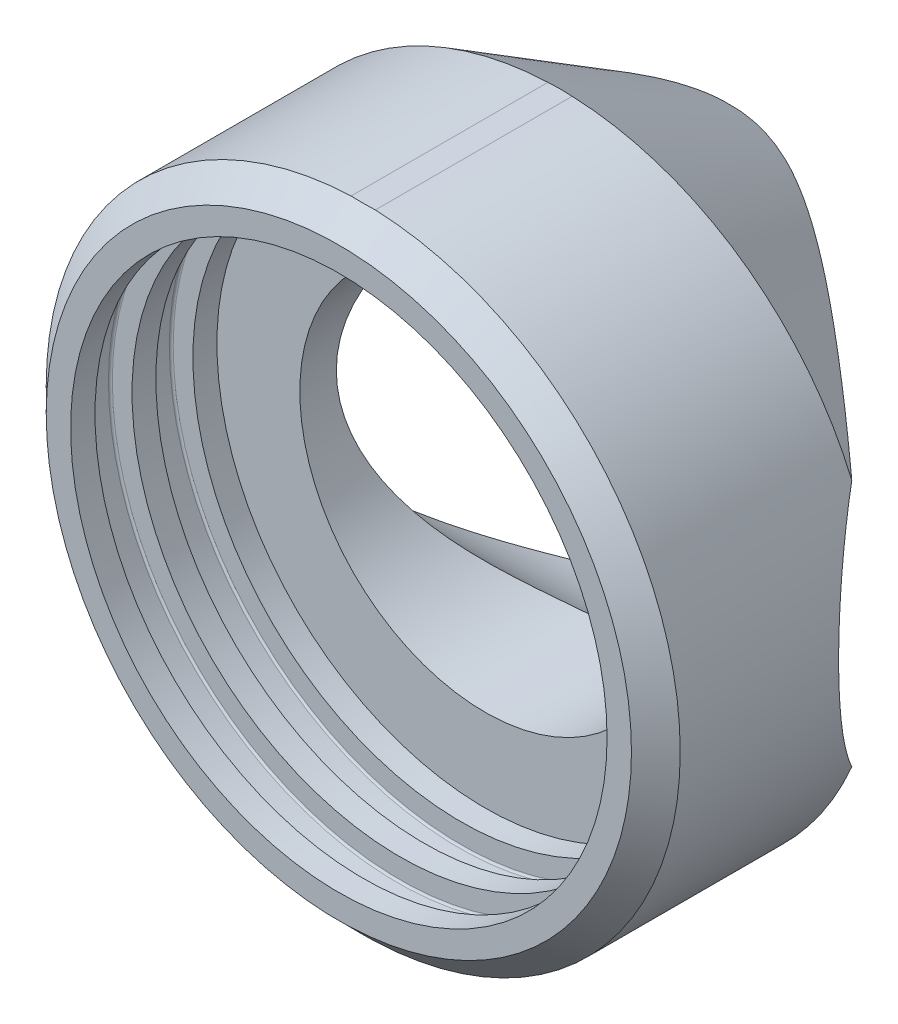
ISO-10303-21;
HEADER;
FILE_DESCRIPTION(('STEP AP214'),'2;1');
FILE_NAME('part.step','',(''),(''),'','','');
FILE_SCHEMA(('AUTOMOTIVE_DESIGN { 1 0 10303 214 1 1 1 1 }'));
ENDSEC;
DATA;
#1=APPLICATION_CONTEXT('core data for automotive mechanical design processes');
#2=APPLICATION_PROTOCOL_DEFINITION('international standard','automotive_design',2000,#1);
#3=PRODUCT_CONTEXT('',#1,'mechanical');
#4=PRODUCT('Part','Part','',(#3));
#5=PRODUCT_RELATED_PRODUCT_CATEGORY('part','',(#4));
#6=PRODUCT_DEFINITION_FORMATION('','',#4);
#7=PRODUCT_DEFINITION_CONTEXT('part definition',#1,'design');
#8=PRODUCT_DEFINITION('design','',#6,#7);
#9=PRODUCT_DEFINITION_SHAPE('','',#8);
#10=(LENGTH_UNIT() NAMED_UNIT(*) SI_UNIT(.MILLI.,.METRE.));
#11=(NAMED_UNIT(*) PLANE_ANGLE_UNIT() SI_UNIT($,.RADIAN.));
#12=(NAMED_UNIT(*) SI_UNIT($,.STERADIAN.) SOLID_ANGLE_UNIT());
#13=UNCERTAINTY_MEASURE_WITH_UNIT(LENGTH_MEASURE(1.E-05),#10,'distance_accuracy_value','');
#14=(GEOMETRIC_REPRESENTATION_CONTEXT(3) GLOBAL_UNCERTAINTY_ASSIGNED_CONTEXT((#13)) GLOBAL_UNIT_ASSIGNED_CONTEXT((#10,
#11,#12)) REPRESENTATION_CONTEXT('',''));
#15=CARTESIAN_POINT('',(0.,0.,0.));
#16=DIRECTION('',(0.,0.,1.));
#17=DIRECTION('',(1.,0.,0.));
#18=AXIS2_PLACEMENT_3D('',#15,#16,#17);
#19=CARTESIAN_POINT('',(0.,0.,-50.8));
#20=DIRECTION('',(0.,0.,1.));
#21=DIRECTION('',(1.,0.,0.));
#22=AXIS2_PLACEMENT_3D('',#19,#20,#21);
#23=CYLINDRICAL_SURFACE('',#22,41.275);
#24=DIRECTION('',(0.,0.,-1.));
#25=VECTOR('',#24,1.);
#26=CARTESIAN_POINT('',(-1.57479999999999,-41.2449467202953,164.773516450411));
#27=LINE('',#26,#25);
#28=CARTESIAN_POINT('',(-1.57480000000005,-41.2449467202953,-3.17500000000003));
#29=VERTEX_POINT('',#28);
#30=CARTESIAN_POINT('',(-1.57480000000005,-41.2449467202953,-28.8029547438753));
#31=VERTEX_POINT('',#30);
#32=EDGE_CURVE('E53',#29,#31,#27,.T.);
#33=ORIENTED_EDGE('',*,*,#32,.F.);
#34=CARTESIAN_POINT('',(0.,0.,-3.17500000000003));
#35=DIRECTION('',(0.,0.,1.));
#36=DIRECTION('',(1.,0.,0.));
#37=AXIS2_PLACEMENT_3D('',#34,#35,#36);
#38=CIRCLE('',#37,41.275);
#39=CARTESIAN_POINT('',(-1.57480000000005,41.2449467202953,-3.17500000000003));
#40=VERTEX_POINT('',#39);
#41=EDGE_CURVE('E477',#29,#40,#38,.F.);
#42=ORIENTED_EDGE('',*,*,#41,.T.);
#43=DIRECTION('',(0.,0.,-1.));
#44=VECTOR('',#43,1.);
#45=CARTESIAN_POINT('',(-1.57479999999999,41.2449467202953,174.703616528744));
#46=LINE('',#45,#44);
#47=CARTESIAN_POINT('',(-1.57479999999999,41.2449467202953,-28.8029547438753));
#48=VERTEX_POINT('',#47);
#49=EDGE_CURVE('E132',#40,#48,#46,.T.);
#50=ORIENTED_EDGE('',*,*,#49,.T.);
#51=CARTESIAN_POINT('',(0.,0.,-28.8029547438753));
#52=DIRECTION('',(0.,0.,1.));
#53=DIRECTION('',(1.,0.,0.));
#54=AXIS2_PLACEMENT_3D('',#51,#52,#53);
#55=CIRCLE('',#54,41.275);
#56=CARTESIAN_POINT('',(-37.9832448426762,16.1523600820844,-28.8029547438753));
#57=VERTEX_POINT('',#56);
#58=EDGE_CURVE('E495',#48,#57,#55,.T.);
#59=ORIENTED_EDGE('',*,*,#58,.T.);
#60=CARTESIAN_POINT('',(-29.8257438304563,-28.5315725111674,-50.8));
#61=CARTESIAN_POINT('',(-29.8448026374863,-28.5116316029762,-50.4384723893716));
#62=CARTESIAN_POINT('',(-29.8704358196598,-28.4848130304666,-50.0776961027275));
#63=CARTESIAN_POINT('',(-29.9343402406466,-28.4176584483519,-49.3585961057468));
#64=CARTESIAN_POINT('',(-29.972609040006,-28.3773250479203,-49.0002719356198));
#65=CARTESIAN_POINT('',(-30.0612017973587,-28.2834555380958,-48.2875291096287));
#66=CARTESIAN_POINT('',(-30.1115038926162,-28.2299433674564,-47.9331045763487));
#67=CARTESIAN_POINT('',(-30.2235089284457,-28.1099956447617,-47.2282853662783));
#68=CARTESIAN_POINT('',(-30.2852123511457,-28.043559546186,-46.8778908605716));
#69=CARTESIAN_POINT('',(-30.4848994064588,-27.8268760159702,-45.8410081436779));
#70=CARTESIAN_POINT('',(-30.6384336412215,-27.6582405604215,-45.1612273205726));
#71=CARTESIAN_POINT('',(-30.9805422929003,-27.2744847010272,-43.8239127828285));
#72=CARTESIAN_POINT('',(-31.1691324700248,-27.0593433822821,-43.1663892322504));
#73=CARTESIAN_POINT('',(-31.5728763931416,-26.5871181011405,-41.8809343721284));
#74=CARTESIAN_POINT('',(-31.787828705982,-26.330347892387,-41.2528238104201));
#75=CARTESIAN_POINT('',(-32.2387837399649,-25.7762294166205,-40.0228097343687));
#76=CARTESIAN_POINT('',(-32.4747840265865,-25.4788858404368,-39.4209032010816));
#77=CARTESIAN_POINT('',(-32.9626518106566,-24.844513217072,-38.242205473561));
#78=CARTESIAN_POINT('',(-33.2145697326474,-24.5073547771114,-37.6655050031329));
#79=CARTESIAN_POINT('',(-33.7280649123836,-23.7957110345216,-36.5400884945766));
#80=CARTESIAN_POINT('',(-33.9896432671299,-23.4212214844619,-35.9913756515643));
#81=CARTESIAN_POINT('',(-34.5678743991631,-22.5611381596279,-34.8206175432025));
#82=CARTESIAN_POINT('',(-34.8855020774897,-22.0679864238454,-34.2045884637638));
#83=CARTESIAN_POINT('',(-35.5196362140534,-21.0321180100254,-33.0149769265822));
#84=CARTESIAN_POINT('',(-35.8361425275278,-20.4893951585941,-32.441399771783));
#85=CARTESIAN_POINT('',(-36.4606293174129,-19.3562982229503,-31.3393923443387));
#86=CARTESIAN_POINT('',(-36.7686164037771,-18.7659625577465,-30.8109263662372));
#87=CARTESIAN_POINT('',(-37.369534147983,-17.5388185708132,-29.8015535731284));
#88=CARTESIAN_POINT('',(-37.6624666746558,-16.9020160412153,-29.3206408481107));
#89=CARTESIAN_POINT('',(-38.1992331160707,-15.6480972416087,-28.4542986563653));
#90=CARTESIAN_POINT('',(-38.4450697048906,-15.0351119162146,-28.0641313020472));
#91=CARTESIAN_POINT('',(-38.9144549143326,-13.77472061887,-27.3284423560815));
#92=CARTESIAN_POINT('',(-39.1380047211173,-13.1273164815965,-26.9829183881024));
#93=CARTESIAN_POINT('',(-39.5581725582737,-11.8008639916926,-26.3399539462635));
#94=CARTESIAN_POINT('',(-39.754799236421,-11.121825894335,-26.0424980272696));
#95=CARTESIAN_POINT('',(-40.1168521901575,-9.73535029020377,-25.4990132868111));
#96=CARTESIAN_POINT('',(-40.2822785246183,-9.02791283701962,-25.2529843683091));
#97=CARTESIAN_POINT('',(-40.5790255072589,-7.5838912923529,-24.8141642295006));
#98=CARTESIAN_POINT('',(-40.7100925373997,-6.84713428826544,-24.6217682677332));
#99=CARTESIAN_POINT('',(-40.9331162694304,-5.35487192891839,-24.2956408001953));
#100=CARTESIAN_POINT('',(-41.0250726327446,-4.59936641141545,-24.1619098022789));
#101=CARTESIAN_POINT('',(-41.1672746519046,-3.07660571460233,-23.9555266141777));
#102=CARTESIAN_POINT('',(-41.2175450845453,-2.30935779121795,-23.8828381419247));
#103=CARTESIAN_POINT('',(-41.2750030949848,-0.769927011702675,-23.7997792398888));
#104=CARTESIAN_POINT('',(-41.2821957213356,0.00225525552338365,-23.7894015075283));
#105=CARTESIAN_POINT('',(-41.2550778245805,1.45021818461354,-23.828582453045));
#106=CARTESIAN_POINT('',(-41.2257089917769,2.12630046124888,-23.8710044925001));
#107=CARTESIAN_POINT('',(-41.134275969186,3.47150064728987,-24.0034065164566));
#108=CARTESIAN_POINT('',(-41.0722149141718,4.14061921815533,-24.0933819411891));
#109=CARTESIAN_POINT('',(-40.9167507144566,5.46729498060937,-24.3196359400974));
#110=CARTESIAN_POINT('',(-40.8233452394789,6.12485130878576,-24.4559179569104));
#111=CARTESIAN_POINT('',(-40.6071522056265,7.42419241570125,-24.773001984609));
#112=CARTESIAN_POINT('',(-40.4843634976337,8.06597657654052,-24.9538057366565));
#113=CARTESIAN_POINT('',(-40.2114808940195,9.33181641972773,-25.3583135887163));
#114=CARTESIAN_POINT('',(-40.0613156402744,9.95582072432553,-25.582129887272));
#115=CARTESIAN_POINT('',(-39.7367030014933,11.1813200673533,-26.0699769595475));
#116=CARTESIAN_POINT('',(-39.5622558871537,11.782815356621,-26.3340072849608));
#117=CARTESIAN_POINT('',(-39.1921298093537,12.9608552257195,-26.8998352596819));
#118=CARTESIAN_POINT('',(-38.9964531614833,13.5374025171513,-27.2016287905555));
#119=CARTESIAN_POINT('',(-38.587008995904,14.6638190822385,-27.8406920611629));
#120=CARTESIAN_POINT('',(-38.3732392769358,15.2136850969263,-28.1779661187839));
#121=CARTESIAN_POINT('',(-37.9001885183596,16.3596130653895,-28.9349119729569));
#122=CARTESIAN_POINT('',(-37.6387072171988,16.9515063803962,-29.3595241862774));
#123=CARTESIAN_POINT('',(-37.1014321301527,18.0972321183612,-30.2490918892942));
#124=CARTESIAN_POINT('',(-36.8256372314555,18.651061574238,-30.7140505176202));
#125=CARTESIAN_POINT('',(-36.2641788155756,19.7205593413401,-31.682967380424));
#126=CARTESIAN_POINT('',(-35.9784955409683,20.2361439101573,-32.1870065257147));
#127=CARTESIAN_POINT('',(-35.4030810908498,21.2267674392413,-33.2313147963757));
#128=CARTESIAN_POINT('',(-35.1133496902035,21.7018041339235,-33.7715859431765));
#129=CARTESIAN_POINT('',(-34.4865194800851,22.6870338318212,-34.9812312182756));
#130=CARTESIAN_POINT('',(-34.1496936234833,23.1895932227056,-35.6569898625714));
#131=CARTESIAN_POINT('',(-33.4877739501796,24.1356165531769,-37.0543982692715));
#132=CARTESIAN_POINT('',(-33.1626827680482,24.5790672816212,-37.7760582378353));
#133=CARTESIAN_POINT('',(-32.5365837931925,25.4020179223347,-39.2604828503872));
#134=CARTESIAN_POINT('',(-32.2354803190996,25.7817793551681,-40.023061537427));
#135=CARTESIAN_POINT('',(-31.6681899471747,26.4755017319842,-41.5900073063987));
#136=CARTESIAN_POINT('',(-31.4019892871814,26.7894886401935,-42.3943577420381));
#137=CARTESIAN_POINT('',(-30.9847535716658,27.269803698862,-43.8141339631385));
#138=CARTESIAN_POINT('',(-30.8221996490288,27.4529764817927,-44.4205213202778));
#139=CARTESIAN_POINT('',(-30.5278265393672,27.7799556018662,-45.6510095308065));
#140=CARTESIAN_POINT('',(-30.3959915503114,27.9237821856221,-46.275101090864));
#141=CARTESIAN_POINT('',(-30.2245033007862,28.1089329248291,-47.2246688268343));
#142=CARTESIAN_POINT('',(-30.1715475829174,28.1657290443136,-47.5448366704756));
#143=CARTESIAN_POINT('',(-30.0752427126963,28.2685403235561,-48.1883482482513));
#144=CARTESIAN_POINT('',(-30.0318932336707,28.3145558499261,-48.5116918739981));
#145=CARTESIAN_POINT('',(-29.9552412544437,28.395638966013,-49.1614468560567));
#146=CARTESIAN_POINT('',(-29.9219543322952,28.4306895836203,-49.4878621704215));
#147=CARTESIAN_POINT('',(-29.8658797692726,28.4895826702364,-50.1426454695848));
#148=CARTESIAN_POINT('',(-29.8430936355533,28.5134235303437,-50.4710137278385));
#149=CARTESIAN_POINT('',(-29.8257438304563,28.5315725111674,-50.8));
#150=B_SPLINE_CURVE_WITH_KNOTS('',3,(#60,#61,#62,#63,#64,#65,#66,#67,#68,#69,#70,#71,#72,#73,
#74,#75,#76,#77,#78,#79,#80,#81,#82,#83,#84,#85,#86,#87,#88,#89,#90,#91,#92,#93,#94,#95,#96,#97,
#98,#99,#100,#101,#102,#103,#104,#105,#106,#107,#108,#109,#110,#111,#112,#113,#114,#115,#116,
#117,#118,#119,#120,#121,#122,#123,#124,#125,#126,#127,#128,#129,#130,#131,#132,#133,#134,#135,
#136,#137,#138,#139,#140,#141,#142,#143,#144,#145,#146,#147,#148,#149),.UNSPECIFIED.,.F.,.F.,(4,
2,2,2,2,2,2,2,2,2,2,2,2,2,2,2,2,2,2,2,2,2,2,2,2,2,2,2,2,2,2,2,2,2,2,2,2,2,2,2,2,2,2,2,4),(0.,
1.08757171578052,2.17493358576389,3.26033468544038,4.34578169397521,6.4936041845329,
8.64239462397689,10.7756844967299,12.9087279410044,15.0489048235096,17.1893254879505,
19.7386463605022,22.2882851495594,24.8358868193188,27.3831714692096,29.6821750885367,
31.9810562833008,34.2791973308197,36.5773340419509,38.8919846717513,41.2066553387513,
43.5199492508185,45.8329720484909,47.8646578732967,49.8961489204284,51.9277910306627,
53.9595126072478,55.9966077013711,58.0336800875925,60.0705305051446,62.1076290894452,
64.4272323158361,66.7470161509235,69.0717380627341,71.3965897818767,74.1144805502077,
76.8329777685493,79.540023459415,82.2459985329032,84.2060863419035,86.1651636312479,
87.1532417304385,88.1412862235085,89.1308525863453,90.1205609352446),.UNSPECIFIED.);
#151=CARTESIAN_POINT('',(-37.9832448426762,-16.1523600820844,-28.8029547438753));
#152=VERTEX_POINT('',#151);
#153=EDGE_CURVE('E224',#152,#57,#150,.T.);
#154=ORIENTED_EDGE('',*,*,#153,.F.);
#155=CARTESIAN_POINT('',(0.,0.,-28.8029547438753));
#156=DIRECTION('',(0.,0.,1.));
#157=DIRECTION('',(1.,0.,0.));
#158=AXIS2_PLACEMENT_3D('',#155,#156,#157);
#159=CIRCLE('',#158,41.275);
#160=EDGE_CURVE('E113',#152,#31,#159,.T.);
#161=ORIENTED_EDGE('',*,*,#160,.T.);
#162=EDGE_LOOP('',(#33,#42,#50,#59,#154,#161));
#163=FACE_BOUND('',#162,.T.);
#164=ADVANCED_FACE('F32',(#163),#23,.T.);
#165=DIRECTION('',(0.,0.,-1.));
#166=VECTOR('',#165,1.);
#167=CARTESIAN_POINT('',(1.57479999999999,-41.2449467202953,164.773516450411));
#168=LINE('',#167,#166);
#169=CARTESIAN_POINT('',(1.57480000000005,-41.2449467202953,-3.17500000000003));
#170=VERTEX_POINT('',#169);
#171=CARTESIAN_POINT('',(1.57479999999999,-41.2449467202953,-28.8029547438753));
#172=VERTEX_POINT('',#171);
#173=EDGE_CURVE('E117',#170,#172,#168,.T.);
#174=ORIENTED_EDGE('',*,*,#173,.T.);
#175=CARTESIAN_POINT('',(37.9832448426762,-16.1523600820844,-28.8029547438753));
#176=VERTEX_POINT('',#175);
#177=EDGE_CURVE('E104',#172,#176,#159,.T.);
#178=ORIENTED_EDGE('',*,*,#177,.T.);
#179=CARTESIAN_POINT('',(29.8257438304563,28.5315725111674,-50.8));
#180=CARTESIAN_POINT('',(29.8448026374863,28.5116316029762,-50.4384723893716));
#181=CARTESIAN_POINT('',(29.8704358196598,28.4848130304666,-50.0776961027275));
#182=CARTESIAN_POINT('',(29.9343402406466,28.4176584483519,-49.3585961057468));
#183=CARTESIAN_POINT('',(29.972609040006,28.3773250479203,-49.0002719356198));
#184=CARTESIAN_POINT('',(30.0612017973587,28.2834555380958,-48.2875291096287));
#185=CARTESIAN_POINT('',(30.1115038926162,28.2299433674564,-47.9331045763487));
#186=CARTESIAN_POINT('',(30.2235089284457,28.1099956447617,-47.2282853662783));
#187=CARTESIAN_POINT('',(30.2852123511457,28.043559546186,-46.8778908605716));
#188=CARTESIAN_POINT('',(30.4848994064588,27.8268760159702,-45.8410081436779));
#189=CARTESIAN_POINT('',(30.6384336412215,27.6582405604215,-45.1612273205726));
#190=CARTESIAN_POINT('',(30.9805422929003,27.2744847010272,-43.8239127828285));
#191=CARTESIAN_POINT('',(31.1691324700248,27.0593433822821,-43.1663892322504));
#192=CARTESIAN_POINT('',(31.5728763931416,26.5871181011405,-41.8809343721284));
#193=CARTESIAN_POINT('',(31.787828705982,26.330347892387,-41.2528238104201));
#194=CARTESIAN_POINT('',(32.2387837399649,25.7762294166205,-40.0228097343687));
#195=CARTESIAN_POINT('',(32.4747840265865,25.4788858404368,-39.4209032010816));
#196=CARTESIAN_POINT('',(32.9626518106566,24.844513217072,-38.242205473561));
#197=CARTESIAN_POINT('',(33.2145697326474,24.5073547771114,-37.6655050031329));
#198=CARTESIAN_POINT('',(33.7280649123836,23.7957110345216,-36.5400884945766));
#199=CARTESIAN_POINT('',(33.9896432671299,23.4212214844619,-35.9913756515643));
#200=CARTESIAN_POINT('',(34.5678743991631,22.5611381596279,-34.8206175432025));
#201=CARTESIAN_POINT('',(34.8855020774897,22.0679864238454,-34.2045884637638));
#202=CARTESIAN_POINT('',(35.5196362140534,21.0321180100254,-33.0149769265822));
#203=CARTESIAN_POINT('',(35.8361425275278,20.4893951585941,-32.441399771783));
#204=CARTESIAN_POINT('',(36.4606293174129,19.3562982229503,-31.3393923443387));
#205=CARTESIAN_POINT('',(36.7686164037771,18.7659625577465,-30.8109263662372));
#206=CARTESIAN_POINT('',(37.369534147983,17.5388185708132,-29.8015535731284));
#207=CARTESIAN_POINT('',(37.6624666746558,16.9020160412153,-29.3206408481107));
#208=CARTESIAN_POINT('',(38.1992331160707,15.6480972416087,-28.4542986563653));
#209=CARTESIAN_POINT('',(38.4450697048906,15.0351119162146,-28.0641313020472));
#210=CARTESIAN_POINT('',(38.9144549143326,13.77472061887,-27.3284423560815));
#211=CARTESIAN_POINT('',(39.1380047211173,13.1273164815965,-26.9829183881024));
#212=CARTESIAN_POINT('',(39.5581725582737,11.8008639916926,-26.3399539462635));
#213=CARTESIAN_POINT('',(39.754799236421,11.121825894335,-26.0424980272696));
#214=CARTESIAN_POINT('',(40.1168521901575,9.73535029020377,-25.4990132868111));
#215=CARTESIAN_POINT('',(40.2822785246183,9.02791283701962,-25.2529843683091));
#216=CARTESIAN_POINT('',(40.5790255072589,7.5838912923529,-24.8141642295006));
#217=CARTESIAN_POINT('',(40.7100925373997,6.84713428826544,-24.6217682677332));
#218=CARTESIAN_POINT('',(40.9331162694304,5.35487192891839,-24.2956408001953));
#219=CARTESIAN_POINT('',(41.0250726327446,4.59936641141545,-24.1619098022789));
#220=CARTESIAN_POINT('',(41.1672746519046,3.07660571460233,-23.9555266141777));
#221=CARTESIAN_POINT('',(41.2175450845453,2.30935779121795,-23.8828381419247));
#222=CARTESIAN_POINT('',(41.2750030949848,0.769927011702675,-23.7997792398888));
#223=CARTESIAN_POINT('',(41.2821957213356,-0.00225525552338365,-23.7894015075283));
#224=CARTESIAN_POINT('',(41.2550778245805,-1.45021818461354,-23.828582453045));
#225=CARTESIAN_POINT('',(41.2257089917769,-2.12630046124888,-23.8710044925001));
#226=CARTESIAN_POINT('',(41.134275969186,-3.47150064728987,-24.0034065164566));
#227=CARTESIAN_POINT('',(41.0722149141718,-4.14061921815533,-24.0933819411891));
#228=CARTESIAN_POINT('',(40.9167507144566,-5.46729498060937,-24.3196359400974));
#229=CARTESIAN_POINT('',(40.8233452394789,-6.12485130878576,-24.4559179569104));
#230=CARTESIAN_POINT('',(40.6071522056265,-7.42419241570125,-24.773001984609));
#231=CARTESIAN_POINT('',(40.4843634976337,-8.06597657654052,-24.9538057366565));
#232=CARTESIAN_POINT('',(40.2114808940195,-9.33181641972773,-25.3583135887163));
#233=CARTESIAN_POINT('',(40.0613156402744,-9.95582072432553,-25.582129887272));
#234=CARTESIAN_POINT('',(39.7367030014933,-11.1813200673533,-26.0699769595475));
#235=CARTESIAN_POINT('',(39.5622558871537,-11.782815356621,-26.3340072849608));
#236=CARTESIAN_POINT('',(39.1921298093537,-12.9608552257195,-26.8998352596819));
#237=CARTESIAN_POINT('',(38.9964531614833,-13.5374025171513,-27.2016287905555));
#238=CARTESIAN_POINT('',(38.587008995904,-14.6638190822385,-27.8406920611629));
#239=CARTESIAN_POINT('',(38.3732392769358,-15.2136850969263,-28.1779661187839));
#240=CARTESIAN_POINT('',(37.9001885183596,-16.3596130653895,-28.9349119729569));
#241=CARTESIAN_POINT('',(37.6387072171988,-16.9515063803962,-29.3595241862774));
#242=CARTESIAN_POINT('',(37.1014321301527,-18.0972321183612,-30.2490918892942));
#243=CARTESIAN_POINT('',(36.8256372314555,-18.651061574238,-30.7140505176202));
#244=CARTESIAN_POINT('',(36.2641788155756,-19.7205593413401,-31.682967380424));
#245=CARTESIAN_POINT('',(35.9784955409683,-20.2361439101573,-32.1870065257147));
#246=CARTESIAN_POINT('',(35.4030810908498,-21.2267674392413,-33.2313147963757));
#247=CARTESIAN_POINT('',(35.1133496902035,-21.7018041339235,-33.7715859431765));
#248=CARTESIAN_POINT('',(34.4865194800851,-22.6870338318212,-34.9812312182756));
#249=CARTESIAN_POINT('',(34.1496936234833,-23.1895932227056,-35.6569898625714));
#250=CARTESIAN_POINT('',(33.4877739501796,-24.1356165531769,-37.0543982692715));
#251=CARTESIAN_POINT('',(33.1626827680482,-24.5790672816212,-37.7760582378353));
#252=CARTESIAN_POINT('',(32.5365837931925,-25.4020179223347,-39.2604828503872));
#253=CARTESIAN_POINT('',(32.2354803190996,-25.7817793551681,-40.023061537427));
#254=CARTESIAN_POINT('',(31.6681899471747,-26.4755017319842,-41.5900073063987));
#255=CARTESIAN_POINT('',(31.4019892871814,-26.7894886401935,-42.3943577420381));
#256=CARTESIAN_POINT('',(30.9847535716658,-27.269803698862,-43.8141339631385));
#257=CARTESIAN_POINT('',(30.8221996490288,-27.4529764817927,-44.4205213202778));
#258=CARTESIAN_POINT('',(30.5278265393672,-27.7799556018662,-45.6510095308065));
#259=CARTESIAN_POINT('',(30.3959915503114,-27.9237821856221,-46.275101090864));
#260=CARTESIAN_POINT('',(30.2245033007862,-28.1089329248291,-47.2246688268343));
#261=CARTESIAN_POINT('',(30.1715475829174,-28.1657290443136,-47.5448366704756));
#262=CARTESIAN_POINT('',(30.0752427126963,-28.2685403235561,-48.1883482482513));
#263=CARTESIAN_POINT('',(30.0318932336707,-28.3145558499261,-48.5116918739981));
#264=CARTESIAN_POINT('',(29.9552412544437,-28.395638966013,-49.1614468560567));
#265=CARTESIAN_POINT('',(29.9219543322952,-28.4306895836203,-49.4878621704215));
#266=CARTESIAN_POINT('',(29.8658797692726,-28.4895826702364,-50.1426454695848));
#267=CARTESIAN_POINT('',(29.8430936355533,-28.5134235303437,-50.4710137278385));
#268=CARTESIAN_POINT('',(29.8257438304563,-28.5315725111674,-50.8));
#269=B_SPLINE_CURVE_WITH_KNOTS('',3,(#179,#180,#181,#182,#183,#184,#185,#186,#187,#188,#189,
#190,#191,#192,#193,#194,#195,#196,#197,#198,#199,#200,#201,#202,#203,#204,#205,#206,#207,#208,
#209,#210,#211,#212,#213,#214,#215,#216,#217,#218,#219,#220,#221,#222,#223,#224,#225,#226,#227,
#228,#229,#230,#231,#232,#233,#234,#235,#236,#237,#238,#239,#240,#241,#242,#243,#244,#245,#246,
#247,#248,#249,#250,#251,#252,#253,#254,#255,#256,#257,#258,#259,#260,#261,#262,#263,#264,#265,
#266,#267,#268),.UNSPECIFIED.,.F.,.F.,(4,2,2,2,2,2,2,2,2,2,2,2,2,2,2,2,2,2,2,2,2,2,2,2,2,2,2,2,
2,2,2,2,2,2,2,2,2,2,2,2,2,2,2,2,4),(0.,1.08757171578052,2.17493358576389,3.26033468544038,
4.34578169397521,6.4936041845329,8.64239462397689,10.7756844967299,12.9087279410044,
15.0489048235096,17.1893254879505,19.7386463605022,22.2882851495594,24.8358868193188,
27.3831714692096,29.6821750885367,31.9810562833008,34.2791973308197,36.5773340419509,
38.8919846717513,41.2066553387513,43.5199492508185,45.8329720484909,47.8646578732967,
49.8961489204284,51.9277910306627,53.9595126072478,55.9966077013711,58.0336800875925,
60.0705305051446,62.1076290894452,64.4272323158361,66.7470161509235,69.0717380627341,
71.3965897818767,74.1144805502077,76.8329777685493,79.540023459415,82.2459985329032,
84.2060863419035,86.1651636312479,87.1532417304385,88.1412862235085,89.1308525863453,
90.1205609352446),.UNSPECIFIED.);
#270=CARTESIAN_POINT('',(37.9832448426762,16.1523600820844,-28.8029547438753));
#271=VERTEX_POINT('',#270);
#272=EDGE_CURVE('E217',#271,#176,#269,.T.);
#273=ORIENTED_EDGE('',*,*,#272,.F.);
#274=CARTESIAN_POINT('',(1.57479999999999,41.2449467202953,-28.8029547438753));
#275=VERTEX_POINT('',#274);
#276=EDGE_CURVE('E114',#271,#275,#55,.T.);
#277=ORIENTED_EDGE('',*,*,#276,.T.);
#278=DIRECTION('',(0.,0.,-1.));
#279=VECTOR('',#278,1.);
#280=CARTESIAN_POINT('',(1.57479999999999,41.2449467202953,174.703616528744));
#281=LINE('',#280,#279);
#282=CARTESIAN_POINT('',(1.57479999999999,41.2449467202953,-3.17500000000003));
#283=VERTEX_POINT('',#282);
#284=EDGE_CURVE('E133',#283,#275,#281,.T.);
#285=ORIENTED_EDGE('',*,*,#284,.F.);
#286=EDGE_CURVE('E120',#283,#170,#38,.F.);
#287=ORIENTED_EDGE('',*,*,#286,.T.);
#288=EDGE_LOOP('',(#174,#178,#273,#277,#285,#287));
#289=FACE_BOUND('',#288,.T.);
#290=ADVANCED_FACE('F118',(#289),#23,.T.);
#291=CARTESIAN_POINT('',(0.,0.,-28.8029547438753));
#292=DIRECTION('',(0.,0.,1.));
#293=DIRECTION('',(1.,0.,0.));
#294=AXIS2_PLACEMENT_3D('',#291,#292,#293);
#295=CONICAL_SURFACE('',#294,41.275,0.5235987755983);
#296=ORIENTED_EDGE('',*,*,#58,.F.);
#297=CARTESIAN_POINT('',(-9.47318176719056,41.2449467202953,-26.9949179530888));
#298=CARTESIAN_POINT('',(-9.08949867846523,41.2449467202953,-27.1436912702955));
#299=CARTESIAN_POINT('',(-8.70287783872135,41.2449467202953,-27.2849981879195));
#300=CARTESIAN_POINT('',(-7.92402204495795,41.2449467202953,-27.5515460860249));
#301=CARTESIAN_POINT('',(-7.53178553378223,41.2449467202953,-27.6767825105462));
#302=CARTESIAN_POINT('',(-6.74150186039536,41.2449467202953,-27.9101702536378));
#303=CARTESIAN_POINT('',(-6.34344590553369,41.2449467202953,-28.0182919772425));
#304=CARTESIAN_POINT('',(-5.54283921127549,41.2449467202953,-28.2160688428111));
#305=CARTESIAN_POINT('',(-5.14028889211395,41.2449467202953,-28.305725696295));
#306=CARTESIAN_POINT('',(-3.95616857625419,41.2449467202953,-28.5396447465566));
#307=CARTESIAN_POINT('',(-3.16915695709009,41.2449467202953,-28.6574854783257));
#308=CARTESIAN_POINT('',(-1.58809211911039,41.2449467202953,-28.8151314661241));
#309=CARTESIAN_POINT('',(-0.794046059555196,41.2449467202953,-28.8550085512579));
#310=CARTESIAN_POINT('',(0.794046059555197,41.2449467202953,-28.8550085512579));
#311=CARTESIAN_POINT('',(1.58809211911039,41.2449467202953,-28.8151314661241));
#312=CARTESIAN_POINT('',(3.16915695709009,41.2449467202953,-28.6574854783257));
#313=CARTESIAN_POINT('',(3.95616857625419,41.2449467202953,-28.5396447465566));
#314=CARTESIAN_POINT('',(5.14028889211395,41.2449467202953,-28.305725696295));
#315=CARTESIAN_POINT('',(5.54283921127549,41.2449467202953,-28.2160688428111));
#316=CARTESIAN_POINT('',(6.34344590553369,41.2449467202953,-28.0182919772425));
#317=CARTESIAN_POINT('',(6.74150186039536,41.2449467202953,-27.9101702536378));
#318=CARTESIAN_POINT('',(7.53178553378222,41.2449467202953,-27.6767825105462));
#319=CARTESIAN_POINT('',(7.92402204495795,41.2449467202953,-27.5515460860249));
#320=CARTESIAN_POINT('',(8.70287783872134,41.2449467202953,-27.2849981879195));
#321=CARTESIAN_POINT('',(9.08949867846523,41.2449467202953,-27.1436912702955));
#322=CARTESIAN_POINT('',(9.47318176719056,41.2449467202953,-26.9949179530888));
#323=B_SPLINE_CURVE_WITH_KNOTS('',3,(#297,#298,#299,#300,#301,#302,#303,#304,#305,#306,#307,
#308,#309,#310,#311,#312,#313,#314,#315,#316,#317,#318,#319,#320,#321,#322),.UNSPECIFIED.,.F.,
.F.,(4,2,2,2,2,2,2,2,2,2,2,2,4),(0.,1.23452945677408,2.46940813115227,3.70639938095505,
4.94327592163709,7.32669140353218,9.70790997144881,12.0891285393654,14.4725440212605,
15.7094205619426,16.9464118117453,18.1812904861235,19.4158199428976),.UNSPECIFIED.);
#324=EDGE_CURVE('E157',#48,#275,#323,.T.);
#325=ORIENTED_EDGE('',*,*,#324,.T.);
#326=ORIENTED_EDGE('',*,*,#276,.F.);
#327=CARTESIAN_POINT('',(1.5747999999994,28.5315725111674,-50.8));
#328=CARTESIAN_POINT('',(1.98654990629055,28.5295705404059,-50.7642407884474));
#329=CARTESIAN_POINT('',(2.39693680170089,28.5267829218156,-50.7144321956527));
#330=CARTESIAN_POINT('',(3.21337347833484,28.5192203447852,-50.5890089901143));
#331=CARTESIAN_POINT('',(3.61942682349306,28.5144471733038,-50.5134175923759));
#332=CARTESIAN_POINT('',(4.42413648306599,28.5025278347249,-50.339124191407));
#333=CARTESIAN_POINT('',(4.8228210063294,28.4953947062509,-50.2405500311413));
#334=CARTESIAN_POINT('',(5.61448700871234,28.4782401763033,-50.0226897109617));
#335=CARTESIAN_POINT('',(6.00746714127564,28.4682181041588,-49.9033987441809));
#336=CARTESIAN_POINT('',(6.78245929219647,28.4449164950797,-49.6483542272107));
#337=CARTESIAN_POINT('',(7.16454703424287,28.4316793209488,-49.5128255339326));
#338=CARTESIAN_POINT('',(7.92275253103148,28.4014067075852,-49.2265471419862));
#339=CARTESIAN_POINT('',(8.29887068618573,28.3843715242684,-49.0757984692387));
#340=CARTESIAN_POINT('',(9.41983321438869,28.3268104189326,-48.6035020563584));
#341=CARTESIAN_POINT('',(10.1561076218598,28.2798615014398,-48.2623055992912));
#342=CARTESIAN_POINT('',(11.5227981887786,28.1724278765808,-47.5843027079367));
#343=CARTESIAN_POINT('',(12.1555040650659,28.1141757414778,-47.2516723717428));
#344=CARTESIAN_POINT('',(13.4068991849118,27.98015520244,-46.5641023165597));
#345=CARTESIAN_POINT('',(14.0255859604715,27.9043837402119,-46.2091587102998));
#346=CARTESIAN_POINT('',(15.25045789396,27.7338723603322,-45.48260999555));
#347=CARTESIAN_POINT('',(15.8566419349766,27.6391307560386,-45.1110034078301));
#348=CARTESIAN_POINT('',(17.0576710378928,27.4294530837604,-44.3554825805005));
#349=CARTESIAN_POINT('',(17.6525168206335,27.3145183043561,-43.971569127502));
#350=CARTESIAN_POINT('',(18.8370325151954,27.0622336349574,-43.1913494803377));
#351=CARTESIAN_POINT('',(19.4266091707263,26.924693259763,-42.7949633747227));
#352=CARTESIAN_POINT('',(20.5957040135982,26.626889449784,-41.9959169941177));
#353=CARTESIAN_POINT('',(21.1752219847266,26.4666255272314,-41.593256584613));
#354=CARTESIAN_POINT('',(22.3242337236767,26.1224263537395,-40.7841704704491));
#355=CARTESIAN_POINT('',(22.8937307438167,25.9384989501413,-40.3777460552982));
#356=CARTESIAN_POINT('',(24.0227830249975,25.545948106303,-39.5631012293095));
#357=CARTESIAN_POINT('',(24.5823386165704,25.3373254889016,-39.1548808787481));
#358=CARTESIAN_POINT('',(26.0765622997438,24.7404304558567,-38.0548392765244));
#359=CARTESIAN_POINT('',(27.0017647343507,24.3280410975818,-37.3630181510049));
#360=CARTESIAN_POINT('',(28.8198208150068,23.4239633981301,-35.9880378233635));
#361=CARTESIAN_POINT('',(29.7126671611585,22.9322572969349,-35.3048805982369));
#362=CARTESIAN_POINT('',(31.4549292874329,21.8670271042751,-33.9602630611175));
#363=CARTESIAN_POINT('',(32.3045757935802,21.2940177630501,-33.2986962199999));
#364=CARTESIAN_POINT('',(33.9575561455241,20.0580772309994,-32.003131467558));
#365=CARTESIAN_POINT('',(34.7609287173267,19.3952228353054,-31.3691106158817));
#366=CARTESIAN_POINT('',(35.9622431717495,18.2925957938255,-30.4162138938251));
#367=CARTESIAN_POINT('',(36.3802454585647,17.8863118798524,-30.0836710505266));
#368=CARTESIAN_POINT('',(37.1970153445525,17.0427491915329,-29.4322778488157));
#369=CARTESIAN_POINT('',(37.5957484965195,16.6054181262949,-29.1134521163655));
#370=CARTESIAN_POINT('',(37.9832448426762,16.1523600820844,-28.8029547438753));
#371=B_SPLINE_CURVE_WITH_KNOTS('',3,(#327,#328,#329,#330,#331,#332,#333,#334,#335,#336,#337,
#338,#339,#340,#341,#342,#343,#344,#345,#346,#347,#348,#349,#350,#351,#352,#353,#354,#355,#356,
#357,#358,#359,#360,#361,#362,#363,#364,#365,#366,#367,#368,#369,#370),.UNSPECIFIED.,.F.,.F.,(4,
2,2,2,2,2,2,2,2,2,2,2,2,2,2,2,2,2,2,2,2,4),(0.,1.23947314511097,2.47783319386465,
3.70946255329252,4.94137806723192,6.15786705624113,7.37427410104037,9.81081344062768,
11.9616618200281,14.1128859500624,16.264301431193,18.4155796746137,20.5860142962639,
22.7564955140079,24.9262587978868,27.0959498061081,30.7729804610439,34.4508355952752,
38.1063662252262,41.7587917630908,43.7710787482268,45.7868392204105),.UNSPECIFIED.);
#372=CARTESIAN_POINT('',(1.5747999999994,28.5315725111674,-50.8));
#373=VERTEX_POINT('',#372);
#374=EDGE_CURVE('E176',#373,#271,#371,.T.);
#375=ORIENTED_EDGE('',*,*,#374,.F.);
#376=CARTESIAN_POINT('',(0.,0.,-50.8));
#377=DIRECTION('',(0.,0.,1.));
#378=DIRECTION('',(1.,0.,0.));
#379=AXIS2_PLACEMENT_3D('',#376,#377,#378);
#380=CIRCLE('',#379,28.575);
#381=CARTESIAN_POINT('',(-1.5747999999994,28.5315725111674,-50.8));
#382=VERTEX_POINT('',#381);
#383=EDGE_CURVE('E481',#382,#373,#380,.F.);
#384=ORIENTED_EDGE('',*,*,#383,.F.);
#385=CARTESIAN_POINT('',(-37.9832448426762,16.1523600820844,-28.8029547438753));
#386=CARTESIAN_POINT('',(-37.6431368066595,16.5500333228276,-29.0754810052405));
#387=CARTESIAN_POINT('',(-37.2943067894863,16.9356349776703,-29.3544746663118));
#388=CARTESIAN_POINT('',(-36.5811226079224,17.6831942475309,-29.9236049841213));
#389=CARTESIAN_POINT('',(-36.216774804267,18.0451613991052,-30.2137370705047));
#390=CARTESIAN_POINT('',(-35.4750281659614,18.7454867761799,-30.8029153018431));
#391=CARTESIAN_POINT('',(-35.097660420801,19.0838961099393,-31.1019400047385));
#392=CARTESIAN_POINT('',(-34.3305336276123,19.738722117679,-31.7080985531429));
#393=CARTESIAN_POINT('',(-33.9407731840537,20.0551363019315,-32.0152333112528));
#394=CARTESIAN_POINT('',(-32.7620504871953,20.9668727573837,-32.9411446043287));
#395=CARTESIAN_POINT('',(-31.9567361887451,21.5311358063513,-33.5699281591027));
#396=CARTESIAN_POINT('',(-30.3097824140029,22.5818552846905,-34.8455760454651));
#397=CARTESIAN_POINT('',(-29.4681172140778,23.0682554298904,-35.4924530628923));
#398=CARTESIAN_POINT('',(-28.014397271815,23.831381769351,-36.5982363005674));
#399=CARTESIAN_POINT('',(-27.4101868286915,24.1269395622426,-37.054603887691));
#400=CARTESIAN_POINT('',(-26.1880500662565,24.6842416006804,-37.9697359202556));
#401=CARTESIAN_POINT('',(-25.570122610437,24.9459830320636,-38.428500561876));
#402=CARTESIAN_POINT('',(-24.3212139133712,25.4372154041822,-39.3460032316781));
#403=CARTESIAN_POINT('',(-23.6902279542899,25.6666944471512,-39.8047411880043));
#404=CARTESIAN_POINT('',(-22.4158333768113,26.0947297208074,-40.7193047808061));
#405=CARTESIAN_POINT('',(-21.7724251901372,26.2932870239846,-41.1751305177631));
#406=CARTESIAN_POINT('',(-20.4692035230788,26.6620164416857,-42.0835797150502));
#407=CARTESIAN_POINT('',(-19.8093143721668,26.8320096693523,-42.5361671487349));
#408=CARTESIAN_POINT('',(-18.4763447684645,27.1436193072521,-43.4316870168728));
#409=CARTESIAN_POINT('',(-17.8032634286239,27.2852338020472,-43.8746187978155));
#410=CARTESIAN_POINT('',(-16.4433933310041,27.5415413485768,-44.7459010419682));
#411=CARTESIAN_POINT('',(-15.7566151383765,27.6562543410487,-45.1742621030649));
#412=CARTESIAN_POINT('',(-14.3673106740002,27.8606333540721,-46.0107634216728));
#413=CARTESIAN_POINT('',(-13.6647872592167,27.9503038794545,-46.4189073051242));
#414=CARTESIAN_POINT('',(-12.2568654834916,28.105029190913,-47.1986572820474));
#415=CARTESIAN_POINT('',(-11.5518533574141,28.1705715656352,-47.5708600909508));
#416=CARTESIAN_POINT('',(-10.1215982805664,28.2821189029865,-48.2783894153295));
#417=CARTESIAN_POINT('',(-9.39634985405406,28.3281185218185,-48.6137058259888));
#418=CARTESIAN_POINT('',(-7.92998544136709,28.4032105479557,-49.2309097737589));
#419=CARTESIAN_POINT('',(-7.18906950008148,28.4324505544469,-49.5132485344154));
#420=CARTESIAN_POINT('',(-5.68494422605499,28.4781435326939,-50.0107625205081));
#421=CARTESIAN_POINT('',(-4.92176384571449,28.4946124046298,-50.2260210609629));
#422=CARTESIAN_POINT('',(-3.72591506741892,28.5131055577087,-50.4926410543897));
#423=CARTESIAN_POINT('',(-3.29995945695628,28.5182939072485,-50.5740901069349));
#424=CARTESIAN_POINT('',(-2.44147947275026,28.5264756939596,-50.708990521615));
#425=CARTESIAN_POINT('',(-2.00893301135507,28.5294581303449,-50.7623011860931));
#426=CARTESIAN_POINT('',(-1.5747999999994,28.5315725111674,-50.8));
#427=B_SPLINE_CURVE_WITH_KNOTS('',3,(#385,#386,#387,#388,#389,#390,#391,#392,#393,#394,#395,
#396,#397,#398,#399,#400,#401,#402,#403,#404,#405,#406,#407,#408,#409,#410,#411,#412,#413,#414,
#415,#416,#417,#418,#419,#420,#421,#422,#423,#424,#425,#426),.UNSPECIFIED.,.F.,.F.,(4,2,2,2,2,2,
2,2,2,2,2,2,2,2,2,2,2,2,2,2,4),(0.,1.76956786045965,3.53841722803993,5.30330111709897,
7.06838445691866,10.5658576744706,14.0658477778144,16.5035486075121,18.941452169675,
21.3802524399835,23.818968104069,26.2724291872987,28.7260558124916,31.1778578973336,
33.6292186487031,36.0278987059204,38.4272342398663,40.8051010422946,43.1800026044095,
44.4802380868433,45.7869148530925),.UNSPECIFIED.);
#428=EDGE_CURVE('E183',#57,#382,#427,.T.);
#429=ORIENTED_EDGE('',*,*,#428,.F.);
#430=EDGE_LOOP('',(#296,#325,#326,#375,#384,#429));
#431=FACE_BOUND('',#430,.T.);
#432=ADVANCED_FACE('F167',(#431),#295,.T.);
#433=CARTESIAN_POINT('',(0.,0.,0.));
#434=DIRECTION('',(0.,0.,-1.));
#435=DIRECTION('',(-1.,0.,0.));
#436=AXIS2_PLACEMENT_3D('',#433,#434,#435);
#437=CONICAL_SURFACE('',#436,38.1,0.785398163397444);
#438=CARTESIAN_POINT('',(6.91328169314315,-41.2449467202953,-3.72031914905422));
#439=CARTESIAN_POINT('',(6.57815665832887,-41.2449467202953,-3.6649174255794));
#440=CARTESIAN_POINT('',(6.24241005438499,-41.2449467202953,-3.61333677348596));
#441=CARTESIAN_POINT('',(5.56980048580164,-41.2449467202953,-3.51799489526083));
#442=CARTESIAN_POINT('',(5.23293749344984,-41.2449467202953,-3.47423386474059));
#443=CARTESIAN_POINT('',(4.22086077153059,-41.2449467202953,-3.35494665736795));
#444=CARTESIAN_POINT('',(3.54418766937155,-41.2449467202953,-3.29142108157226));
#445=CARTESIAN_POINT('',(2.194798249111,-41.2449467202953,-3.19786747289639));
#446=CARTESIAN_POINT('',(1.52210274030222,-41.2449467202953,-3.16753687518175));
#447=CARTESIAN_POINT('',(0.176073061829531,-41.2449467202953,-3.13983443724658));
#448=CARTESIAN_POINT('',(-0.497261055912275,-41.2449467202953,-3.1424601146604));
#449=CARTESIAN_POINT('',(-1.84279183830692,-41.2449467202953,-3.18061767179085));
#450=CARTESIAN_POINT('',(-2.51498877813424,-41.2449467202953,-3.21613992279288));
#451=CARTESIAN_POINT('',(-3.85694847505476,-41.2449467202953,-3.31948785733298));
#452=CARTESIAN_POINT('',(-4.52671100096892,-41.2449467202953,-3.38731653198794));
#453=CARTESIAN_POINT('',(-5.86851648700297,-41.2449467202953,-3.55499064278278));
#454=CARTESIAN_POINT('',(-6.5405227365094,-41.2449467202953,-3.65512794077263));
#455=CARTESIAN_POINT('',(-7.87920018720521,-41.2449467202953,-3.88560844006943));
#456=CARTESIAN_POINT('',(-8.54587248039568,-41.2449467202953,-4.01594528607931));
#457=CARTESIAN_POINT('',(-9.20935339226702,-41.2449467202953,-4.16059417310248));
#458=B_SPLINE_CURVE_WITH_KNOTS('',3,(#438,#439,#440,#441,#442,#443,#444,#445,#446,#447,#448,
#449,#450,#451,#452,#453,#454,#455,#456,#457),.UNSPECIFIED.,.F.,.F.,(4,2,2,2,2,2,2,2,2,4),(0.,
1.01897661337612,2.03797871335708,4.0760691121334,6.09542394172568,8.11462666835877,
10.1332385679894,12.1520373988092,14.1896092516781,16.2267526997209),.UNSPECIFIED.);
#459=EDGE_CURVE('E60',#170,#29,#458,.T.);
#460=ORIENTED_EDGE('',*,*,#459,.F.);
#461=ORIENTED_EDGE('',*,*,#286,.F.);
#462=CARTESIAN_POINT('',(6.91328169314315,41.2449467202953,-3.72031914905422));
#463=CARTESIAN_POINT('',(6.57815665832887,41.2449467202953,-3.6649174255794));
#464=CARTESIAN_POINT('',(6.24241005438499,41.2449467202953,-3.61333677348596));
#465=CARTESIAN_POINT('',(5.56980048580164,41.2449467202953,-3.51799489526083));
#466=CARTESIAN_POINT('',(5.23293749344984,41.2449467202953,-3.47423386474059));
#467=CARTESIAN_POINT('',(4.22086077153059,41.2449467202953,-3.35494665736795));
#468=CARTESIAN_POINT('',(3.54418766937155,41.2449467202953,-3.29142108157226));
#469=CARTESIAN_POINT('',(2.194798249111,41.2449467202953,-3.19786747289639));
#470=CARTESIAN_POINT('',(1.52210274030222,41.2449467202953,-3.16753687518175));
#471=CARTESIAN_POINT('',(0.176073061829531,41.2449467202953,-3.13983443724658));
#472=CARTESIAN_POINT('',(-0.497261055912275,41.2449467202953,-3.1424601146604));
#473=CARTESIAN_POINT('',(-1.84279183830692,41.2449467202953,-3.18061767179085));
#474=CARTESIAN_POINT('',(-2.51498877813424,41.2449467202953,-3.21613992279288));
#475=CARTESIAN_POINT('',(-3.85694847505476,41.2449467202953,-3.31948785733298));
#476=CARTESIAN_POINT('',(-4.52671100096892,41.2449467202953,-3.38731653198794));
#477=CARTESIAN_POINT('',(-5.86851648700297,41.2449467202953,-3.55499064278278));
#478=CARTESIAN_POINT('',(-6.5405227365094,41.2449467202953,-3.65512794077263));
#479=CARTESIAN_POINT('',(-7.87920018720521,41.2449467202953,-3.88560844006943));
#480=CARTESIAN_POINT('',(-8.54587248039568,41.2449467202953,-4.01594528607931));
#481=CARTESIAN_POINT('',(-9.20935339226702,41.2449467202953,-4.16059417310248));
#482=B_SPLINE_CURVE_WITH_KNOTS('',3,(#462,#463,#464,#465,#466,#467,#468,#469,#470,#471,#472,
#473,#474,#475,#476,#477,#478,#479,#480,#481),.UNSPECIFIED.,.F.,.F.,(4,2,2,2,2,2,2,2,2,4),(0.,
1.01897661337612,2.03797871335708,4.0760691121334,6.09542394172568,8.11462666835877,
10.1332385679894,12.1520373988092,14.1896092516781,16.2267526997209),.UNSPECIFIED.);
#483=EDGE_CURVE('E46',#283,#40,#482,.T.);
#484=ORIENTED_EDGE('',*,*,#483,.T.);
#485=ORIENTED_EDGE('',*,*,#41,.F.);
#486=EDGE_LOOP('',(#460,#461,#484,#485));
#487=FACE_BOUND('',#486,.T.);
#488=CARTESIAN_POINT('',(0.,0.,0.));
#489=DIRECTION('',(0.,0.,1.));
#490=DIRECTION('',(1.,0.,0.));
#491=AXIS2_PLACEMENT_3D('',#488,#489,#490);
#492=CIRCLE('',#491,38.1);
#493=CARTESIAN_POINT('',(38.1,0.,0.));
#494=VERTEX_POINT('',#493);
#495=EDGE_CURVE('E478',#494,#494,#492,.T.);
#496=ORIENTED_EDGE('',*,*,#495,.F.);
#497=EDGE_LOOP('',(#496));
#498=FACE_BOUND('',#497,.T.);
#499=ADVANCED_FACE('F135',(#487,#498),#437,.T.);
#500=CARTESIAN_POINT('',(0.,0.,-19.05));
#501=DIRECTION('',(0.,0.,1.));
#502=DIRECTION('',(1.,0.,0.));
#503=AXIS2_PLACEMENT_3D('',#500,#501,#502);
#504=CYLINDRICAL_SURFACE('',#503,34.925);
#505=CARTESIAN_POINT('',(0.,0.,-11.0998));
#506=DIRECTION('',(0.,0.,1.));
#507=DIRECTION('',(1.,0.,0.));
#508=AXIS2_PLACEMENT_3D('',#505,#506,#507);
#509=CIRCLE('',#508,34.925);
#510=CARTESIAN_POINT('',(34.925,0.,-11.0998));
#511=VERTEX_POINT('',#510);
#512=EDGE_CURVE('E468',#511,#511,#509,.F.);
#513=CARTESIAN_POINT('',(0.,0.,-8.001));
#514=DIRECTION('',(0.,0.,1.));
#515=DIRECTION('',(1.,0.,0.));
#516=AXIS2_PLACEMENT_3D('',#513,#514,#515);
#517=CIRCLE('',#516,34.925);
#518=CARTESIAN_POINT('',(34.925,0.,-8.001));
#519=VERTEX_POINT('',#518);
#520=EDGE_CURVE('E465',#519,#519,#517,.F.);
#521=CARTESIAN_POINT('',(34.925,0.,-11.0998));
#522=CARTESIAN_POINT('',(34.925,0.,-11.0675208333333));
#523=CARTESIAN_POINT('',(34.925,0.,-11.0352416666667));
#524=CARTESIAN_POINT('',(34.925,0.,-10.9706833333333));
#525=CARTESIAN_POINT('',(34.925,0.,-10.9384041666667));
#526=CARTESIAN_POINT('',(34.925,0.,-10.8738458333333));
#527=CARTESIAN_POINT('',(34.925,0.,-10.8415666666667));
#528=CARTESIAN_POINT('',(34.925,0.,-10.7770083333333));
#529=CARTESIAN_POINT('',(34.925,0.,-10.7447291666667));
#530=CARTESIAN_POINT('',(34.925,0.,-10.6801708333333));
#531=CARTESIAN_POINT('',(34.925,0.,-10.6478916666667));
#532=CARTESIAN_POINT('',(34.925,0.,-10.5833333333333));
#533=CARTESIAN_POINT('',(34.925,0.,-10.5510541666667));
#534=CARTESIAN_POINT('',(34.925,0.,-10.4864958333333));
#535=CARTESIAN_POINT('',(34.925,0.,-10.4542166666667));
#536=CARTESIAN_POINT('',(34.925,0.,-10.3896583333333));
#537=CARTESIAN_POINT('',(34.925,0.,-10.3573791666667));
#538=CARTESIAN_POINT('',(34.925,0.,-10.2928208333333));
#539=CARTESIAN_POINT('',(34.925,0.,-10.2605416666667));
#540=CARTESIAN_POINT('',(34.925,0.,-10.1959833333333));
#541=CARTESIAN_POINT('',(34.925,0.,-10.1637041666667));
#542=CARTESIAN_POINT('',(34.925,0.,-10.0991458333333));
#543=CARTESIAN_POINT('',(34.925,0.,-10.0668666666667));
#544=CARTESIAN_POINT('',(34.925,0.,-10.0023083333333));
#545=CARTESIAN_POINT('',(34.925,0.,-9.97002916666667));
#546=CARTESIAN_POINT('',(34.925,0.,-9.90547083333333));
#547=CARTESIAN_POINT('',(34.925,0.,-9.87319166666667));
#548=CARTESIAN_POINT('',(34.925,0.,-9.80863333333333));
#549=CARTESIAN_POINT('',(34.925,0.,-9.77635416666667));
#550=CARTESIAN_POINT('',(34.925,0.,-9.71179583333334));
#551=CARTESIAN_POINT('',(34.925,0.,-9.67951666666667));
#552=CARTESIAN_POINT('',(34.925,0.,-9.61495833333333));
#553=CARTESIAN_POINT('',(34.925,0.,-9.58267916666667));
#554=CARTESIAN_POINT('',(34.925,0.,-9.51812083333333));
#555=CARTESIAN_POINT('',(34.925,0.,-9.48584166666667));
#556=CARTESIAN_POINT('',(34.925,0.,-9.42128333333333));
#557=CARTESIAN_POINT('',(34.925,0.,-9.38900416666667));
#558=CARTESIAN_POINT('',(34.925,0.,-9.32444583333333));
#559=CARTESIAN_POINT('',(34.925,0.,-9.29216666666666));
#560=CARTESIAN_POINT('',(34.925,0.,-9.22760833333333));
#561=CARTESIAN_POINT('',(34.925,0.,-9.19532916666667));
#562=CARTESIAN_POINT('',(34.925,0.,-9.13077083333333));
#563=CARTESIAN_POINT('',(34.925,0.,-9.09849166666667));
#564=CARTESIAN_POINT('',(34.925,0.,-9.03393333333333));
#565=CARTESIAN_POINT('',(34.925,0.,-9.00165416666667));
#566=CARTESIAN_POINT('',(34.925,0.,-8.93709583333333));
#567=CARTESIAN_POINT('',(34.925,0.,-8.90481666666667));
#568=CARTESIAN_POINT('',(34.925,0.,-8.84025833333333));
#569=CARTESIAN_POINT('',(34.925,0.,-8.80797916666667));
#570=CARTESIAN_POINT('',(34.925,0.,-8.74342083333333));
#571=CARTESIAN_POINT('',(34.925,0.,-8.71114166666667));
#572=CARTESIAN_POINT('',(34.925,0.,-8.64658333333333));
#573=CARTESIAN_POINT('',(34.925,0.,-8.61430416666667));
#574=CARTESIAN_POINT('',(34.925,0.,-8.54974583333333));
#575=CARTESIAN_POINT('',(34.925,0.,-8.51746666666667));
#576=CARTESIAN_POINT('',(34.925,0.,-8.45290833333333));
#577=CARTESIAN_POINT('',(34.925,0.,-8.42062916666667));
#578=CARTESIAN_POINT('',(34.925,0.,-8.35607083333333));
#579=CARTESIAN_POINT('',(34.925,0.,-8.32379166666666));
#580=CARTESIAN_POINT('',(34.925,0.,-8.25923333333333));
#581=CARTESIAN_POINT('',(34.925,0.,-8.22695416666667));
#582=CARTESIAN_POINT('',(34.925,0.,-8.16239583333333));
#583=CARTESIAN_POINT('',(34.925,0.,-8.13011666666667));
#584=CARTESIAN_POINT('',(34.925,0.,-8.06555833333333));
#585=CARTESIAN_POINT('',(34.925,0.,-8.03327916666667));
#586=CARTESIAN_POINT('',(34.925,0.,-8.001));
#587=B_SPLINE_CURVE_WITH_KNOTS('',3,(#521,#522,#523,#524,#525,#526,#527,#528,#529,#530,#531,
#532,#533,#534,#535,#536,#537,#538,#539,#540,#541,#542,#543,#544,#545,#546,#547,#548,#549,#550,
#551,#552,#553,#554,#555,#556,#557,#558,#559,#560,#561,#562,#563,#564,#565,#566,#567,#568,#569,
#570,#571,#572,#573,#574,#575,#576,#577,#578,#579,#580,#581,#582,#583,#584,#585,#586),
.UNSPECIFIED.,.F.,.F.,(4,2,2,2,2,2,2,2,2,2,2,2,2,2,2,2,2,2,2,2,2,2,2,2,2,2,2,2,2,2,2,2,4),(0.,
0.0968375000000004,0.193675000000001,0.290512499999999,0.38735,0.4841875,0.581025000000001,
0.677862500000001,0.7747,0.8715375,0.968375,1.0652125,1.16205,1.2588875,1.355725,1.4525625,
1.5494,1.6462375,1.743075,1.8399125,1.93675,2.0335875,2.130425,2.2272625,2.3241,2.4209375,
2.517775,2.6146125,2.71145,2.8082875,2.905125,3.0019625,3.0988),.UNSPECIFIED.);
#588=EDGE_CURVE('BSEAM251',#511,#519,#587,.T.);
#589=ORIENTED_EDGE('',*,*,#512,.T.);
#590=ORIENTED_EDGE('',*,*,#520,.F.);
#591=ORIENTED_EDGE('',*,*,#588,.T.);
#592=ORIENTED_EDGE('',*,*,#588,.F.);
#593=EDGE_LOOP('',(#589,#591,#590,#592));
#594=FACE_BOUND('',#593,.T.);
#595=ADVANCED_FACE('F251',(#594),#504,.F.);
#596=CARTESIAN_POINT('',(0.,0.,-19.05));
#597=DIRECTION('',(0.,0.,1.));
#598=DIRECTION('',(1.,0.,0.));
#599=AXIS2_PLACEMENT_3D('',#596,#597,#598);
#600=CIRCLE('',#599,34.925);
#601=CARTESIAN_POINT('',(34.925,0.,-19.05));
#602=VERTEX_POINT('',#601);
#603=EDGE_CURVE('E499',#602,#602,#600,.T.);
#604=CARTESIAN_POINT('',(0.,0.,-15.9258));
#605=DIRECTION('',(0.,0.,1.));
#606=DIRECTION('',(1.,0.,0.));
#607=AXIS2_PLACEMENT_3D('',#604,#605,#606);
#608=CIRCLE('',#607,34.925);
#609=CARTESIAN_POINT('',(34.925,0.,-15.9258));
#610=VERTEX_POINT('',#609);
#611=EDGE_CURVE('E471',#610,#610,#608,.F.);
#612=CARTESIAN_POINT('',(34.925,0.,-19.05));
#613=CARTESIAN_POINT('',(34.925,0.,-19.01745625));
#614=CARTESIAN_POINT('',(34.925,0.,-18.9849125));
#615=CARTESIAN_POINT('',(34.925,0.,-18.919825));
#616=CARTESIAN_POINT('',(34.925,0.,-18.88728125));
#617=CARTESIAN_POINT('',(34.925,0.,-18.82219375));
#618=CARTESIAN_POINT('',(34.925,0.,-18.78965));
#619=CARTESIAN_POINT('',(34.925,0.,-18.7245625));
#620=CARTESIAN_POINT('',(34.925,0.,-18.69201875));
#621=CARTESIAN_POINT('',(34.925,0.,-18.62693125));
#622=CARTESIAN_POINT('',(34.925,0.,-18.5943875));
#623=CARTESIAN_POINT('',(34.925,0.,-18.5293));
#624=CARTESIAN_POINT('',(34.925,0.,-18.49675625));
#625=CARTESIAN_POINT('',(34.925,0.,-18.43166875));
#626=CARTESIAN_POINT('',(34.925,0.,-18.399125));
#627=CARTESIAN_POINT('',(34.925,0.,-18.3340375));
#628=CARTESIAN_POINT('',(34.925,0.,-18.30149375));
#629=CARTESIAN_POINT('',(34.925,0.,-18.23640625));
#630=CARTESIAN_POINT('',(34.925,0.,-18.2038625));
#631=CARTESIAN_POINT('',(34.925,0.,-18.138775));
#632=CARTESIAN_POINT('',(34.925,0.,-18.10623125));
#633=CARTESIAN_POINT('',(34.925,0.,-18.04114375));
#634=CARTESIAN_POINT('',(34.925,0.,-18.0086));
#635=CARTESIAN_POINT('',(34.925,0.,-17.9435125));
#636=CARTESIAN_POINT('',(34.925,0.,-17.91096875));
#637=CARTESIAN_POINT('',(34.925,0.,-17.84588125));
#638=CARTESIAN_POINT('',(34.925,0.,-17.8133375));
#639=CARTESIAN_POINT('',(34.925,0.,-17.74825));
#640=CARTESIAN_POINT('',(34.925,0.,-17.71570625));
#641=CARTESIAN_POINT('',(34.925,0.,-17.65061875));
#642=CARTESIAN_POINT('',(34.925,0.,-17.618075));
#643=CARTESIAN_POINT('',(34.925,0.,-17.5529875));
#644=CARTESIAN_POINT('',(34.925,0.,-17.52044375));
#645=CARTESIAN_POINT('',(34.925,0.,-17.45535625));
#646=CARTESIAN_POINT('',(34.925,0.,-17.4228125));
#647=CARTESIAN_POINT('',(34.925,0.,-17.357725));
#648=CARTESIAN_POINT('',(34.925,0.,-17.32518125));
#649=CARTESIAN_POINT('',(34.925,0.,-17.26009375));
#650=CARTESIAN_POINT('',(34.925,0.,-17.22755));
#651=CARTESIAN_POINT('',(34.925,0.,-17.1624625));
#652=CARTESIAN_POINT('',(34.925,0.,-17.12991875));
#653=CARTESIAN_POINT('',(34.925,0.,-17.06483125));
#654=CARTESIAN_POINT('',(34.925,0.,-17.0322875));
#655=CARTESIAN_POINT('',(34.925,0.,-16.9672));
#656=CARTESIAN_POINT('',(34.925,0.,-16.93465625));
#657=CARTESIAN_POINT('',(34.925,0.,-16.86956875));
#658=CARTESIAN_POINT('',(34.925,0.,-16.837025));
#659=CARTESIAN_POINT('',(34.925,0.,-16.7719375));
#660=CARTESIAN_POINT('',(34.925,0.,-16.73939375));
#661=CARTESIAN_POINT('',(34.925,0.,-16.67430625));
#662=CARTESIAN_POINT('',(34.925,0.,-16.6417625));
#663=CARTESIAN_POINT('',(34.925,0.,-16.576675));
#664=CARTESIAN_POINT('',(34.925,0.,-16.54413125));
#665=CARTESIAN_POINT('',(34.925,0.,-16.47904375));
#666=CARTESIAN_POINT('',(34.925,0.,-16.4465));
#667=CARTESIAN_POINT('',(34.925,0.,-16.3814125));
#668=CARTESIAN_POINT('',(34.925,0.,-16.34886875));
#669=CARTESIAN_POINT('',(34.925,0.,-16.28378125));
#670=CARTESIAN_POINT('',(34.925,0.,-16.2512375));
#671=CARTESIAN_POINT('',(34.925,0.,-16.18615));
#672=CARTESIAN_POINT('',(34.925,0.,-16.15360625));
#673=CARTESIAN_POINT('',(34.925,0.,-16.08851875));
#674=CARTESIAN_POINT('',(34.925,0.,-16.055975));
#675=CARTESIAN_POINT('',(34.925,0.,-15.9908875));
#676=CARTESIAN_POINT('',(34.925,0.,-15.95834375));
#677=CARTESIAN_POINT('',(34.925,0.,-15.9258));
#678=B_SPLINE_CURVE_WITH_KNOTS('',3,(#612,#613,#614,#615,#616,#617,#618,#619,#620,#621,#622,
#623,#624,#625,#626,#627,#628,#629,#630,#631,#632,#633,#634,#635,#636,#637,#638,#639,#640,#641,
#642,#643,#644,#645,#646,#647,#648,#649,#650,#651,#652,#653,#654,#655,#656,#657,#658,#659,#660,
#661,#662,#663,#664,#665,#666,#667,#668,#669,#670,#671,#672,#673,#674,#675,#676,#677),
.UNSPECIFIED.,.F.,.F.,(4,2,2,2,2,2,2,2,2,2,2,2,2,2,2,2,2,2,2,2,2,2,2,2,2,2,2,2,2,2,2,2,4),(0.,
0.0976312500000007,0.195262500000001,0.292893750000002,0.390525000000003,0.488156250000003,
0.585787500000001,0.683418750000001,0.781050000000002,0.878681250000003,0.976312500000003,
1.07394375,1.171575,1.26920625,1.3668375,1.46446875,1.5621,1.65973125,1.7573625,1.85499375,
1.952625,2.05025625,2.1478875,2.24551875,2.34315,2.44078125,2.5384125,2.63604375,2.733675,
2.83130625,2.9289375,3.02656875,3.1242),.UNSPECIFIED.);
#679=EDGE_CURVE('BSEAM252',#602,#610,#678,.T.);
#680=ORIENTED_EDGE('',*,*,#603,.F.);
#681=ORIENTED_EDGE('',*,*,#611,.F.);
#682=ORIENTED_EDGE('',*,*,#679,.T.);
#683=ORIENTED_EDGE('',*,*,#679,.F.);
#684=EDGE_LOOP('',(#680,#682,#681,#683));
#685=FACE_BOUND('',#684,.T.);
#686=ADVANCED_FACE('F252',(#685),#504,.F.);
#687=CARTESIAN_POINT('',(0.,0.,-50.8));
#688=DIRECTION('',(0.,0.,1.));
#689=DIRECTION('',(1.,0.,0.));
#690=AXIS2_PLACEMENT_3D('',#687,#688,#689);
#691=PLANE('',#690);
#692=DIRECTION('',(1.,0.,0.));
#693=VECTOR('',#692,1.);
#694=CARTESIAN_POINT('',(-41.275,-28.5315725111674,-50.8));
#695=LINE('',#694,#693);
#696=CARTESIAN_POINT('',(-1.5747999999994,-28.5315725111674,-50.8));
#697=VERTEX_POINT('',#696);
#698=CARTESIAN_POINT('',(1.5747999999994,-28.5315725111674,-50.8));
#699=VERTEX_POINT('',#698);
#700=EDGE_CURVE('E232',#697,#699,#695,.T.);
#701=ORIENTED_EDGE('',*,*,#700,.T.);
#702=CARTESIAN_POINT('',(0.,0.,-50.8));
#703=DIRECTION('',(0.,0.,1.));
#704=DIRECTION('',(1.,0.,0.));
#705=AXIS2_PLACEMENT_3D('',#702,#703,#704);
#706=CIRCLE('',#705,28.575);
#707=EDGE_CURVE('E483',#699,#697,#706,.F.);
#708=ORIENTED_EDGE('',*,*,#707,.T.);
#709=EDGE_LOOP('',(#701,#708));
#710=FACE_BOUND('',#709,.T.);
#711=ADVANCED_FACE('F246',(#710),#691,.F.);
#712=DIRECTION('',(1.,0.,0.));
#713=VECTOR('',#712,1.);
#714=CARTESIAN_POINT('',(-41.275,28.5315725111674,-50.8));
#715=LINE('',#714,#713);
#716=EDGE_CURVE('E165',#373,#382,#715,.F.);
#717=ORIENTED_EDGE('',*,*,#716,.T.);
#718=ORIENTED_EDGE('',*,*,#383,.T.);
#719=EDGE_LOOP('',(#717,#718));
#720=FACE_BOUND('',#719,.T.);
#721=ADVANCED_FACE('F242',(#720),#691,.F.);
#722=CARTESIAN_POINT('',(0.,0.,0.));
#723=DIRECTION('',(0.,0.,1.));
#724=DIRECTION('',(1.,0.,0.));
#725=AXIS2_PLACEMENT_3D('',#722,#723,#724);
#726=PLANE('',#725);
#727=ORIENTED_EDGE('',*,*,#495,.T.);
#728=EDGE_LOOP('',(#727));
#729=FACE_BOUND('',#728,.T.);
#730=CARTESIAN_POINT('',(0.,0.,0.));
#731=DIRECTION('',(0.,0.,1.));
#732=DIRECTION('',(1.,0.,0.));
#733=AXIS2_PLACEMENT_3D('',#730,#731,#732);
#734=CIRCLE('',#733,34.925);
#735=CARTESIAN_POINT('',(34.925,0.,0.));
#736=VERTEX_POINT('',#735);
#737=EDGE_CURVE('E501',#736,#736,#734,.T.);
#738=ORIENTED_EDGE('',*,*,#737,.F.);
#739=EDGE_LOOP('',(#738));
#740=FACE_BOUND('',#739,.T.);
#741=ADVANCED_FACE('F237',(#729,#740),#726,.T.);
#742=CARTESIAN_POINT('',(0.,0.,-19.05));
#743=DIRECTION('',(0.,0.,1.));
#744=DIRECTION('',(1.,0.,0.));
#745=AXIS2_PLACEMENT_3D('',#742,#743,#744);
#746=PLANE('',#745);
#747=CARTESIAN_POINT('',(0.,0.,-19.05));
#748=DIRECTION('',(0.,0.,1.));
#749=DIRECTION('',(1.,0.,0.));
#750=AXIS2_PLACEMENT_3D('',#747,#748,#749);
#751=CIRCLE('',#750,24.13);
#752=CARTESIAN_POINT('',(24.13,0.,-19.05));
#753=VERTEX_POINT('',#752);
#754=EDGE_CURVE('E505',#753,#753,#751,.T.);
#755=ORIENTED_EDGE('',*,*,#754,.F.);
#756=EDGE_LOOP('',(#755));
#757=FACE_BOUND('',#756,.T.);
#758=ORIENTED_EDGE('',*,*,#603,.T.);
#759=EDGE_LOOP('',(#758));
#760=FACE_BOUND('',#759,.T.);
#761=ADVANCED_FACE('F241',(#757,#760),#746,.T.);
#762=CARTESIAN_POINT('',(0.,0.,-3.175));
#763=DIRECTION('',(0.,0.,1.));
#764=DIRECTION('',(1.,0.,0.));
#765=AXIS2_PLACEMENT_3D('',#762,#763,#764);
#766=CIRCLE('',#765,34.925);
#767=CARTESIAN_POINT('',(34.925,0.,-3.175));
#768=VERTEX_POINT('',#767);
#769=EDGE_CURVE('E164',#768,#768,#766,.F.);
#770=CARTESIAN_POINT('',(34.925,0.,-3.175));
#771=CARTESIAN_POINT('',(34.925,0.,-3.14192708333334));
#772=CARTESIAN_POINT('',(34.925,0.,-3.10885416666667));
#773=CARTESIAN_POINT('',(34.925,0.,-3.04270833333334));
#774=CARTESIAN_POINT('',(34.925,0.,-3.00963541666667));
#775=CARTESIAN_POINT('',(34.925,0.,-2.94348958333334));
#776=CARTESIAN_POINT('',(34.925,0.,-2.91041666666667));
#777=CARTESIAN_POINT('',(34.925,0.,-2.84427083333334));
#778=CARTESIAN_POINT('',(34.925,0.,-2.81119791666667));
#779=CARTESIAN_POINT('',(34.925,0.,-2.74505208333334));
#780=CARTESIAN_POINT('',(34.925,0.,-2.71197916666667));
#781=CARTESIAN_POINT('',(34.925,0.,-2.64583333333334));
#782=CARTESIAN_POINT('',(34.925,0.,-2.61276041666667));
#783=CARTESIAN_POINT('',(34.925,0.,-2.54661458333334));
#784=CARTESIAN_POINT('',(34.925,0.,-2.51354166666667));
#785=CARTESIAN_POINT('',(34.925,0.,-2.44739583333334));
#786=CARTESIAN_POINT('',(34.925,0.,-2.41432291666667));
#787=CARTESIAN_POINT('',(34.925,0.,-2.34817708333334));
#788=CARTESIAN_POINT('',(34.925,0.,-2.31510416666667));
#789=CARTESIAN_POINT('',(34.925,0.,-2.24895833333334));
#790=CARTESIAN_POINT('',(34.925,0.,-2.21588541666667));
#791=CARTESIAN_POINT('',(34.925,0.,-2.14973958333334));
#792=CARTESIAN_POINT('',(34.925,0.,-2.11666666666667));
#793=CARTESIAN_POINT('',(34.925,0.,-2.05052083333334));
#794=CARTESIAN_POINT('',(34.925,0.,-2.01744791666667));
#795=CARTESIAN_POINT('',(34.925,0.,-1.95130208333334));
#796=CARTESIAN_POINT('',(34.925,0.,-1.91822916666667));
#797=CARTESIAN_POINT('',(34.925,0.,-1.85208333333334));
#798=CARTESIAN_POINT('',(34.925,0.,-1.81901041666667));
#799=CARTESIAN_POINT('',(34.925,0.,-1.75286458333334));
#800=CARTESIAN_POINT('',(34.925,0.,-1.71979166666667));
#801=CARTESIAN_POINT('',(34.925,0.,-1.65364583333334));
#802=CARTESIAN_POINT('',(34.925,0.,-1.62057291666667));
#803=CARTESIAN_POINT('',(34.925,0.,-1.55442708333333));
#804=CARTESIAN_POINT('',(34.925,0.,-1.52135416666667));
#805=CARTESIAN_POINT('',(34.925,0.,-1.45520833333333));
#806=CARTESIAN_POINT('',(34.925,0.,-1.42213541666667));
#807=CARTESIAN_POINT('',(34.925,0.,-1.35598958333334));
#808=CARTESIAN_POINT('',(34.925,0.,-1.32291666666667));
#809=CARTESIAN_POINT('',(34.925,0.,-1.25677083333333));
#810=CARTESIAN_POINT('',(34.925,0.,-1.22369791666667));
#811=CARTESIAN_POINT('',(34.925,0.,-1.15755208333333));
#812=CARTESIAN_POINT('',(34.925,0.,-1.12447916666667));
#813=CARTESIAN_POINT('',(34.925,0.,-1.05833333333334));
#814=CARTESIAN_POINT('',(34.925,0.,-1.02526041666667));
#815=CARTESIAN_POINT('',(34.925,0.,-0.959114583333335));
#816=CARTESIAN_POINT('',(34.925,0.,-0.926041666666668));
#817=CARTESIAN_POINT('',(34.925,0.,-0.859895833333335));
#818=CARTESIAN_POINT('',(34.925,0.,-0.826822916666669));
#819=CARTESIAN_POINT('',(34.925,0.,-0.760677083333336));
#820=CARTESIAN_POINT('',(34.925,0.,-0.727604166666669));
#821=CARTESIAN_POINT('',(34.925,0.,-0.661458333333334));
#822=CARTESIAN_POINT('',(34.925,0.,-0.628385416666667));
#823=CARTESIAN_POINT('',(34.925,0.,-0.562239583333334));
#824=CARTESIAN_POINT('',(34.925,0.,-0.529166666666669));
#825=CARTESIAN_POINT('',(34.925,0.,-0.463020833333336));
#826=CARTESIAN_POINT('',(34.925,0.,-0.429947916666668));
#827=CARTESIAN_POINT('',(34.925,0.,-0.363802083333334));
#828=CARTESIAN_POINT('',(34.925,0.,-0.330729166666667));
#829=CARTESIAN_POINT('',(34.925,0.,-0.264583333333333));
#830=CARTESIAN_POINT('',(34.925,0.,-0.231510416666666));
#831=CARTESIAN_POINT('',(34.925,0.,-0.165364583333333));
#832=CARTESIAN_POINT('',(34.925,0.,-0.132291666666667));
#833=CARTESIAN_POINT('',(34.925,0.,-0.0661458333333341));
#834=CARTESIAN_POINT('',(34.925,0.,-0.0330729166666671));
#835=CARTESIAN_POINT('',(34.925,0.,0.));
#836=B_SPLINE_CURVE_WITH_KNOTS('',3,(#770,#771,#772,#773,#774,#775,#776,#777,#778,#779,#780,
#781,#782,#783,#784,#785,#786,#787,#788,#789,#790,#791,#792,#793,#794,#795,#796,#797,#798,#799,
#800,#801,#802,#803,#804,#805,#806,#807,#808,#809,#810,#811,#812,#813,#814,#815,#816,#817,#818,
#819,#820,#821,#822,#823,#824,#825,#826,#827,#828,#829,#830,#831,#832,#833,#834,#835),
.UNSPECIFIED.,.F.,.F.,(4,2,2,2,2,2,2,2,2,2,2,2,2,2,2,2,2,2,2,2,2,2,2,2,2,2,2,2,2,2,2,2,4),(0.,
0.0992187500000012,0.198437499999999,0.29765625,0.396875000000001,0.496093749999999,0.5953125,
0.694531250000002,0.793750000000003,0.892968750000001,0.992187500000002,1.09140625,1.190625,
1.28984375,1.3890625,1.48828125,1.5875,1.68671875,1.7859375,1.88515625,1.984375,2.08359375,
2.1828125,2.28203125,2.38125,2.48046875,2.5796875,2.67890625,2.778125,2.87734375,
2.97656250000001,3.07578125,3.175),.UNSPECIFIED.);
#837=EDGE_CURVE('BSEAM248',#768,#736,#836,.T.);
#838=ORIENTED_EDGE('',*,*,#769,.T.);
#839=ORIENTED_EDGE('',*,*,#737,.T.);
#840=ORIENTED_EDGE('',*,*,#837,.T.);
#841=ORIENTED_EDGE('',*,*,#837,.F.);
#842=EDGE_LOOP('',(#838,#840,#839,#841));
#843=FACE_BOUND('',#842,.T.);
#844=ADVANCED_FACE('F248',(#843),#504,.F.);
#845=CARTESIAN_POINT('',(0.,0.,-50.8));
#846=DIRECTION('',(0.,0.,1.));
#847=DIRECTION('',(1.,0.,0.));
#848=AXIS2_PLACEMENT_3D('',#845,#846,#847);
#849=CYLINDRICAL_SURFACE('',#848,24.13);
#850=CARTESIAN_POINT('',(24.13,0.,-23.7998));
#851=CARTESIAN_POINT('',(24.1299962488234,-0.570386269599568,-23.7998036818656));
#852=CARTESIAN_POINT('',(24.1097392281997,-1.14083536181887,-23.8169154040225));
#853=CARTESIAN_POINT('',(24.029074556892,-2.27708908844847,-23.8849826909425));
#854=CARTESIAN_POINT('',(23.9686467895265,-2.8428912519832,-23.9359552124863));
#855=CARTESIAN_POINT('',(23.8086123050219,-3.96600840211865,-24.0707034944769));
#856=CARTESIAN_POINT('',(23.7089342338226,-4.52330600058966,-24.1545389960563));
#857=CARTESIAN_POINT('',(23.4721703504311,-5.6241552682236,-24.3531590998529));
#858=CARTESIAN_POINT('',(23.3350883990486,-6.16770834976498,-24.4679405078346));
#859=CARTESIAN_POINT('',(23.0267353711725,-7.23411651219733,-24.7252592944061));
#860=CARTESIAN_POINT('',(22.8556968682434,-7.75708488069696,-24.8676077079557));
#861=CARTESIAN_POINT('',(22.4812607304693,-8.78340712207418,-25.1779282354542));
#862=CARTESIAN_POINT('',(22.2778629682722,-9.28676091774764,-25.3459004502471));
#863=CARTESIAN_POINT('',(21.8412187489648,-10.2717213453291,-25.7046467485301));
#864=CARTESIAN_POINT('',(21.6079783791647,-10.7533323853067,-25.8954161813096));
#865=CARTESIAN_POINT('',(21.1139348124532,-11.6936213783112,-26.2970076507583));
#866=CARTESIAN_POINT('',(20.8531256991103,-12.1522943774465,-26.5078339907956));
#867=CARTESIAN_POINT('',(20.3918724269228,-12.9057300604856,-26.8779446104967));
#868=CARTESIAN_POINT('',(20.1980951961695,-13.2068490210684,-27.0326993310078));
#869=CARTESIAN_POINT('',(19.7993006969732,-13.7975195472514,-27.349385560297));
#870=CARTESIAN_POINT('',(19.594285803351,-14.0870735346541,-27.5113155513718));
#871=CARTESIAN_POINT('',(18.9630521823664,-14.9385047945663,-28.0067294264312));
#872=CARTESIAN_POINT('',(18.5207186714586,-15.4830308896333,-28.3497773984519));
#873=CARTESIAN_POINT('',(17.5961530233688,-16.5263299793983,-29.0550940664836));
#874=CARTESIAN_POINT('',(17.1138233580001,-17.0249844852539,-29.4174089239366));
#875=CARTESIAN_POINT('',(16.1129990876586,-17.9750993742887,-30.1534723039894));
#876=CARTESIAN_POINT('',(15.5945091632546,-18.4265658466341,-30.5272193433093));
#877=CARTESIAN_POINT('',(14.5125384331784,-19.2907175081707,-31.2860422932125));
#878=CARTESIAN_POINT('',(13.9483833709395,-19.7024881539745,-31.6711977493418));
#879=CARTESIAN_POINT('',(12.784177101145,-20.47708141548,-32.4369863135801));
#880=CARTESIAN_POINT('',(12.1841139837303,-20.8398876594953,-32.8176178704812));
#881=CARTESIAN_POINT('',(10.948409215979,-21.5147339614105,-33.5626124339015));
#882=CARTESIAN_POINT('',(10.3128511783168,-21.8268870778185,-33.9270103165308));
#883=CARTESIAN_POINT('',(9.33076523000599,-22.2558092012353,-34.4510507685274));
#884=CARTESIAN_POINT('',(8.99869212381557,-22.3922049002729,-34.6219344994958));
#885=CARTESIAN_POINT('',(8.3245594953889,-22.6514689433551,-34.9539544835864));
#886=CARTESIAN_POINT('',(7.98250151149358,-22.774339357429,-35.1150922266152));
#887=CARTESIAN_POINT('',(7.26165601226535,-23.0147864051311,-35.4368663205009));
#888=CARTESIAN_POINT('',(6.88205628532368,-23.1312455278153,-35.596528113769));
#889=CARTESIAN_POINT('',(6.11093847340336,-23.3468104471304,-35.8978044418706));
#890=CARTESIAN_POINT('',(5.71942190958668,-23.4459184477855,-36.0394212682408));
#891=CARTESIAN_POINT('',(4.9255089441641,-23.62544277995,-36.3001578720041));
#892=CARTESIAN_POINT('',(4.52313345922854,-23.7058925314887,-36.4193178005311));
#893=CARTESIAN_POINT('',(3.70805192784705,-23.8469747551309,-36.630955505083));
#894=CARTESIAN_POINT('',(3.29534894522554,-23.9076130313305,-36.7234410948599));
#895=CARTESIAN_POINT('',(2.45573977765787,-24.0084866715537,-36.878608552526));
#896=CARTESIAN_POINT('',(2.02871554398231,-24.0484237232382,-36.9408538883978));
#897=CARTESIAN_POINT('',(1.16947233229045,-24.1054877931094,-37.0301284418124));
#898=CARTESIAN_POINT('',(0.737253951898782,-24.1226174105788,-37.0571616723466));
#899=CARTESIAN_POINT('',(-0.12805552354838,-24.1335374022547,-37.074371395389));
#900=CARTESIAN_POINT('',(-0.561146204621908,-24.1273370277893,-37.0645624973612));
#901=CARTESIAN_POINT('',(-1.42402484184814,-24.0918157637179,-37.0087306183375));
#902=CARTESIAN_POINT('',(-1.8538124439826,-24.0624924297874,-36.962703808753));
#903=CARTESIAN_POINT('',(-2.72821136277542,-23.9795011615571,-36.8338775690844));
#904=CARTESIAN_POINT('',(-3.17244634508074,-23.9246573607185,-36.7493065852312));
#905=CARTESIAN_POINT('',(-4.04990860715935,-23.7918511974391,-36.5478322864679));
#906=CARTESIAN_POINT('',(-4.4831344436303,-23.7138858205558,-36.4309247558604));
#907=CARTESIAN_POINT('',(-5.33797550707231,-23.5362295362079,-36.1698168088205));
#908=CARTESIAN_POINT('',(-5.75955450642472,-23.4364779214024,-36.0255402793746));
#909=CARTESIAN_POINT('',(-6.58931352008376,-23.2168505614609,-35.7151299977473));
#910=CARTESIAN_POINT('',(-6.99748804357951,-23.0969666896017,-35.5489874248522));
#911=CARTESIAN_POINT('',(-7.72314658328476,-22.863201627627,-35.2331698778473));
#912=CARTESIAN_POINT('',(-8.04299427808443,-22.7525885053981,-35.0864592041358));
#913=CARTESIAN_POINT('',(-8.67391848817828,-22.5196151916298,-34.7840629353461));
#914=CARTESIAN_POINT('',(-8.98499694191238,-22.3972576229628,-34.6283793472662));
#915=CARTESIAN_POINT('',(-9.90594855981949,-22.0129988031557,-34.1504960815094));
#916=CARTESIAN_POINT('',(-10.5032339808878,-21.7340103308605,-33.8176000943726));
#917=CARTESIAN_POINT('',(-11.6665255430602,-21.1324026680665,-33.1352654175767));
#918=CARTESIAN_POINT('',(-12.2324868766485,-20.8097231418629,-32.7858042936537));
#919=CARTESIAN_POINT('',(-13.33340478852,-20.1220833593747,-32.0800933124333));
#920=CARTESIAN_POINT('',(-13.8683679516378,-19.7571321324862,-31.7238449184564));
#921=CARTESIAN_POINT('',(-14.9407598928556,-18.9606086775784,-30.9893402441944));
#922=CARTESIAN_POINT('',(-15.4761701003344,-18.5262720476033,-30.6111293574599));
#923=CARTESIAN_POINT('',(-16.5112704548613,-17.6100150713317,-29.863294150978));
#924=CARTESIAN_POINT('',(-17.0109554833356,-17.1280879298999,-29.4936710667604));
#925=CARTESIAN_POINT('',(-17.9714805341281,-16.1173143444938,-28.7708159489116));
#926=CARTESIAN_POINT('',(-18.4323842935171,-15.5885479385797,-28.4175574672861));
#927=CARTESIAN_POINT('',(-19.0923939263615,-14.7601486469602,-27.9049380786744));
#928=CARTESIAN_POINT('',(-19.307157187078,-14.4781641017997,-27.7369555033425));
#929=CARTESIAN_POINT('',(-19.7258011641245,-13.9023884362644,-27.407536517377));
#930=CARTESIAN_POINT('',(-19.9296791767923,-13.608594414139,-27.2461017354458));
#931=CARTESIAN_POINT('',(-20.43891165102,-12.8384548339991,-26.8407572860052));
#932=CARTESIAN_POINT('',(-20.7358208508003,-12.3535631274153,-26.6023234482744));
#933=CARTESIAN_POINT('',(-21.2983886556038,-11.3561992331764,-26.1475681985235));
#934=CARTESIAN_POINT('',(-21.5640542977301,-10.8437332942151,-25.9312418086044));
#935=CARTESIAN_POINT('',(-22.0612099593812,-9.79273729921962,-25.5242817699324));
#936=CARTESIAN_POINT('',(-22.2927073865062,-9.25421292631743,-25.333642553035));
#937=CARTESIAN_POINT('',(-22.7184626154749,-8.15331920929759,-24.9815903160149));
#938=CARTESIAN_POINT('',(-22.912719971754,-7.59094957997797,-24.8201776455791));
#939=CARTESIAN_POINT('',(-23.2624328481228,-6.44054671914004,-24.5287036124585));
#940=CARTESIAN_POINT('',(-23.4175318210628,-5.85233118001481,-24.3989306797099));
#941=CARTESIAN_POINT('',(-23.6837932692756,-4.65922316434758,-24.1756773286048));
#942=CARTESIAN_POINT('',(-23.7949555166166,-4.05433060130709,-24.0821970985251));
#943=CARTESIAN_POINT('',(-23.9709758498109,-2.83358642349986,-23.933999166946));
#944=CARTESIAN_POINT('',(-24.0358682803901,-2.2177432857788,-23.879252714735));
#945=CARTESIAN_POINT('',(-24.1180281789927,-0.980671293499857,-23.8099175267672));
#946=CARTESIAN_POINT('',(-24.1353023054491,-0.359443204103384,-23.7953231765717));
#947=CARTESIAN_POINT('',(-24.1227792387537,0.797837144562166,-23.8058969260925));
#948=CARTESIAN_POINT('',(-24.0990466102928,1.33401783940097,-23.8259421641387));
#949=CARTESIAN_POINT('',(-24.0161546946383,2.40162178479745,-23.8958795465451));
#950=CARTESIAN_POINT('',(-23.9569992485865,2.93304554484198,-23.9457684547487));
#951=CARTESIAN_POINT('',(-23.8042367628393,3.98735435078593,-24.0743809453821));
#952=CARTESIAN_POINT('',(-23.710629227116,4.51023927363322,-24.1531049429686));
#953=CARTESIAN_POINT('',(-23.4904111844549,5.54408238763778,-24.3378680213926));
#954=CARTESIAN_POINT('',(-23.3637992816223,6.05504007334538,-24.4439082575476));
#955=CARTESIAN_POINT('',(-23.0804885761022,7.05814953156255,-24.680456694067));
#956=CARTESIAN_POINT('',(-22.9240336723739,7.55041741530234,-24.8107663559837));
#957=CARTESIAN_POINT('',(-22.5823697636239,8.51802514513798,-25.0942563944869));
#958=CARTESIAN_POINT('',(-22.3971618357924,8.99336562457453,-25.2474359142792));
#959=CARTESIAN_POINT('',(-21.9999692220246,9.92547033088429,-25.5744333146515));
#960=CARTESIAN_POINT('',(-21.787979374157,10.3822309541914,-25.7482551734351));
#961=CARTESIAN_POINT('',(-21.3392174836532,11.2758504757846,-26.1142007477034));
#962=CARTESIAN_POINT('',(-21.1024404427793,11.7127053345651,-26.3063281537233));
#963=CARTESIAN_POINT('',(-20.4969070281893,12.7529607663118,-26.7944928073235));
#964=CARTESIAN_POINT('',(-20.1158600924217,13.3452367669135,-27.099105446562));
#965=CARTESIAN_POINT('',(-19.3112377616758,14.4851702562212,-27.7346559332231));
#966=CARTESIAN_POINT('',(-18.8876463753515,15.0328108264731,-28.0656036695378));
#967=CARTESIAN_POINT('',(-18.0009883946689,16.0840050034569,-28.7479318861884));
#968=CARTESIAN_POINT('',(-17.5378325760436,16.5874534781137,-29.0993579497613));
#969=CARTESIAN_POINT('',(-16.5759366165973,17.5487201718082,-29.8152756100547));
#970=CARTESIAN_POINT('',(-16.0772009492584,18.0065441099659,-30.1797655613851));
#971=CARTESIAN_POINT('',(-15.036431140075,18.8847781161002,-30.9217766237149));
#972=CARTESIAN_POINT('',(-14.4937692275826,19.3043449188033,-31.2994141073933));
#973=CARTESIAN_POINT('',(-13.3739091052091,20.0964178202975,-32.0532971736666));
#974=CARTESIAN_POINT('',(-12.7967018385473,20.468911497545,-32.4295423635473));
#975=CARTESIAN_POINT('',(-11.6083094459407,21.1654856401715,-33.1703516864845));
#976=CARTESIAN_POINT('',(-10.9971833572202,21.4896468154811,-33.5349344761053));
#977=CARTESIAN_POINT('',(-9.73851694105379,22.0885396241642,-34.2408346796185));
#978=CARTESIAN_POINT('',(-9.09100045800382,22.3633031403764,-34.5821670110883));
#979=CARTESIAN_POINT('',(-8.04377071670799,22.753444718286,-35.087075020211));
#980=CARTESIAN_POINT('',(-7.65706854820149,22.8865943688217,-35.2640333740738));
#981=CARTESIAN_POINT('',(-6.87060447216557,23.134860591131,-35.6012312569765));
#982=CARTESIAN_POINT('',(-6.47084026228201,23.2499739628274,-35.7614678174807));
#983=CARTESIAN_POINT('',(-5.65910266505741,23.4607537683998,-36.060477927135));
#984=CARTESIAN_POINT('',(-5.24715118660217,23.5564529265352,-36.1992874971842));
#985=CARTESIAN_POINT('',(-4.41130486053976,23.7271787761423,-36.4507693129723));
#986=CARTESIAN_POINT('',(-3.98741747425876,23.8022180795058,-36.5634574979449));
#987=CARTESIAN_POINT('',(-3.1936908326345,23.9205597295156,-36.743189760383));
#988=CARTESIAN_POINT('',(-2.82529037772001,23.9669353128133,-36.814546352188));
#989=CARTESIAN_POINT('',(-2.08276063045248,24.0428411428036,-36.9320882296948));
#990=CARTESIAN_POINT('',(-1.70863202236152,24.0723733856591,-36.978276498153));
#991=CARTESIAN_POINT('',(-0.957372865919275,24.1139319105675,-37.0434455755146));
#992=CARTESIAN_POINT('',(-0.58024549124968,24.1259747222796,-37.0624520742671));
#993=CARTESIAN_POINT('',(0.174541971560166,24.1323199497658,-37.0724538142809));
#994=CARTESIAN_POINT('',(0.552202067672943,24.1266220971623,-37.0634486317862));
#995=CARTESIAN_POINT('',(1.30457221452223,24.0976455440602,-37.0178858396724));
#996=CARTESIAN_POINT('',(1.67928589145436,24.0743937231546,-36.9813703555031));
#997=CARTESIAN_POINT('',(2.42378008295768,24.010868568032,-36.8824715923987));
#998=CARTESIAN_POINT('',(2.79356050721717,23.9705949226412,-36.8200878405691));
#999=CARTESIAN_POINT('',(3.52671532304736,23.8737538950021,-36.6718605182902));
#1000=CARTESIAN_POINT('',(3.89007998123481,23.8171636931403,-36.585984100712));
#1001=CARTESIAN_POINT('',(4.60863057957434,23.6886203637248,-36.3937720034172));
#1002=CARTESIAN_POINT('',(4.96381377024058,23.6166621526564,-36.2874295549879));
#1003=CARTESIAN_POINT('',(5.87901911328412,23.4100174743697,-35.9872410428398));
#1004=CARTESIAN_POINT('',(6.43193831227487,23.2638304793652,-35.7795676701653));
#1005=CARTESIAN_POINT('',(7.51375786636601,22.9373075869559,-35.3311063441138));
#1006=CARTESIAN_POINT('',(8.04264269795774,22.7569499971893,-35.0902973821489));
#1007=CARTESIAN_POINT('',(9.07857848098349,22.3639031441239,-34.5846520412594));
#1008=CARTESIAN_POINT('',(9.58555316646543,22.1511110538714,-34.3197403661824));
#1009=CARTESIAN_POINT('',(10.5768982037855,21.6952474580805,-33.7744460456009));
#1010=CARTESIAN_POINT('',(11.0612706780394,21.4521788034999,-33.4940648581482));
#1011=CARTESIAN_POINT('',(11.8732520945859,21.0102633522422,-33.0053659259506));
#1012=CARTESIAN_POINT('',(12.2061609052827,20.8185839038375,-32.7993094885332));
#1013=CARTESIAN_POINT('',(12.8611743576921,20.4204304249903,-32.3843177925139));
#1014=CARTESIAN_POINT('',(13.1832782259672,20.2139553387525,-32.17538232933));
#1015=CARTESIAN_POINT('',(14.1337842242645,19.5723768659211,-31.5466713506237));
#1016=CARTESIAN_POINT('',(14.7462726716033,19.1151792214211,-31.1250574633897));
#1017=CARTESIAN_POINT('',(15.9270730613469,18.1430207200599,-30.2892331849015));
#1018=CARTESIAN_POINT('',(16.4954432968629,17.6281383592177,-29.8750136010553));
#1019=CARTESIAN_POINT('',(17.5863088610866,16.5400013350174,-29.0634444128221));
#1020=CARTESIAN_POINT('',(18.1088231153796,15.9667709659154,-28.6660878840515));
#1021=CARTESIAN_POINT('',(18.986503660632,14.9038982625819,-27.9882682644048));
#1022=CARTESIAN_POINT('',(19.3521076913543,14.4263480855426,-27.7023088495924));
#1023=CARTESIAN_POINT('',(20.0513411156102,13.4375321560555,-27.1501301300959));
#1024=CARTESIAN_POINT('',(20.3849719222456,12.9262678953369,-26.8839099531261));
#1025=CARTESIAN_POINT('',(21.016825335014,11.8712881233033,-26.3758491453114));
#1026=CARTESIAN_POINT('',(21.3150783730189,11.3276011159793,-26.1339875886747));
#1027=CARTESIAN_POINT('',(21.733280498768,10.4889956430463,-25.7927997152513));
#1028=CARTESIAN_POINT('',(21.8678132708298,10.2056270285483,-25.6826753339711));
#1029=CARTESIAN_POINT('',(22.1267486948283,9.63136159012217,-25.4701301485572));
#1030=CARTESIAN_POINT('',(22.2511486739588,9.34046280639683,-25.3677113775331));
#1031=CARTESIAN_POINT('',(22.5688279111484,8.55484967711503,-25.1055294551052));
#1032=CARTESIAN_POINT('',(22.752625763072,8.05375933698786,-24.9531476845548));
#1033=CARTESIAN_POINT('',(23.0882238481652,7.03412013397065,-24.6740576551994));
#1034=CARTESIAN_POINT('',(23.2400301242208,6.51557458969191,-24.5473445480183));
#1035=CARTESIAN_POINT('',(23.509303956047,5.46471607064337,-24.3220699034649));
#1036=CARTESIAN_POINT('',(23.6268369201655,4.93243145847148,-24.2234547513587));
#1037=CARTESIAN_POINT('',(23.8260604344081,3.85677401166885,-24.0560437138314));
#1038=CARTESIAN_POINT('',(23.9077671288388,3.31340628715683,-23.9872343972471));
#1039=CARTESIAN_POINT('',(24.0237076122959,2.30881710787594,-23.8895150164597));
#1040=CARTESIAN_POINT('',(24.0635177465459,1.84868433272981,-23.8559219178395));
#1041=CARTESIAN_POINT('',(24.1166680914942,0.92571517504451,-23.8110606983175));
#1042=CARTESIAN_POINT('',(24.1300030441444,0.46287827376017,-23.7997970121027));
#1043=CARTESIAN_POINT('',(24.13,0.,-23.7998));
#1044=B_SPLINE_CURVE_WITH_KNOTS('',3,(#850,#851,#852,#853,#854,#855,#856,#857,#858,#859,#860,
#861,#862,#863,#864,#865,#866,#867,#868,#869,#870,#871,#872,#873,#874,#875,#876,#877,#878,#879,
#880,#881,#882,#883,#884,#885,#886,#887,#888,#889,#890,#891,#892,#893,#894,#895,#896,#897,#898,
#899,#900,#901,#902,#903,#904,#905,#906,#907,#908,#909,#910,#911,#912,#913,#914,#915,#916,#917,
#918,#919,#920,#921,#922,#923,#924,#925,#926,#927,#928,#929,#930,#931,#932,#933,#934,#935,#936,
#937,#938,#939,#940,#941,#942,#943,#944,#945,#946,#947,#948,#949,#950,#951,#952,#953,#954,#955,
#956,#957,#958,#959,#960,#961,#962,#963,#964,#965,#966,#967,#968,#969,#970,#971,#972,#973,#974,
#975,#976,#977,#978,#979,#980,#981,#982,#983,#984,#985,#986,#987,#988,#989,#990,#991,#992,#993,
#994,#995,#996,#997,#998,#999,#1000,#1001,#1002,#1003,#1004,#1005,#1006,#1007,#1008,#1009,#1010,
#1011,#1012,#1013,#1014,#1015,#1016,#1017,#1018,#1019,#1020,#1021,#1022,#1023,#1024,#1025,#1026,
#1027,#1028,#1029,#1030,#1031,#1032,#1033,#1034,#1035,#1036,#1037,#1038,#1039,#1040,#1041,#1042,
#1043),.UNSPECIFIED.,.T.,.F.,(4,2,2,2,2,2,2,2,2,2,2,2,2,2,2,2,2,2,2,2,2,2,2,2,2,2,2,2,2,2,2,2,2,
2,2,2,2,2,2,2,2,2,2,2,2,2,2,2,2,2,2,2,2,2,2,2,2,2,2,2,2,2,2,2,2,2,2,2,2,2,2,2,2,2,2,2,2,2,2,2,2,
2,2,2,2,2,2,2,2,2,2,2,2,2,2,2,4),(0.,1.7106580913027,3.42217349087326,5.13681476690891,
6.85127912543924,8.5543825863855,10.2574927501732,11.9602560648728,13.6633855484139,
14.8332708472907,16.0029098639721,18.3426470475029,20.6882674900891,23.0335848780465,
25.4240791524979,27.8153707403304,30.2012492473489,31.3936354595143,32.5858389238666,
33.868922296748,35.1518425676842,36.4324468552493,37.7126756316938,39.0108731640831,
40.3089227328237,41.6064576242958,42.9041296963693,44.2686253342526,45.6332989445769,
47.0018248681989,48.3709045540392,49.4770804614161,50.5830099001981,52.7959075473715,
55.0118928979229,57.2274057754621,59.5842125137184,61.9413562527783,64.294547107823,
65.4709580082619,66.6476597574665,68.4955024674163,70.3429281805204,72.1899527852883,
74.0369994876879,75.9003022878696,77.7636147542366,79.6255426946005,81.487210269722,
83.0964656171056,84.7055464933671,86.314650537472,87.9238226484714,89.5203670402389,
91.1168516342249,92.7136444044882,94.3107597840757,96.6093548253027,98.9088171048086,
101.213609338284,103.518112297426,105.865011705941,108.212529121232,110.556081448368,
112.898115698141,114.234283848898,115.570688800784,116.904822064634,118.238139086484,
119.37130267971,120.504331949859,121.636289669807,122.768264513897,123.898509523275,
125.028775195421,126.160629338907,127.292858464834,129.115207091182,130.938716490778,
132.768132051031,134.597375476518,135.904754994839,137.212227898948,139.827591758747,
142.439438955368,145.050203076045,147.046333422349,149.042375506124,151.036687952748,
152.033760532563,153.031095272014,154.694470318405,156.357530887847,158.017396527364,
159.676513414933,161.064466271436,162.452694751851),.UNSPECIFIED.);
#1045=CARTESIAN_POINT('',(24.13,0.,-23.7998));
#1046=VERTEX_POINT('',#1045);
#1047=EDGE_CURVE('E209',#1046,#1046,#1044,.T.);
#1048=ORIENTED_EDGE('',*,*,#1047,.T.);
#1049=EDGE_LOOP('',(#1048));
#1050=FACE_BOUND('',#1049,.T.);
#1051=ORIENTED_EDGE('',*,*,#754,.T.);
#1052=EDGE_LOOP('',(#1051));
#1053=FACE_BOUND('',#1052,.T.);
#1054=ADVANCED_FACE('F200',(#1050,#1053),#849,.F.);
#1055=CARTESIAN_POINT('',(-41.275,0.,-52.3748));
#1056=DIRECTION('',(1.,0.,0.));
#1057=DIRECTION('',(0.,0.,-1.));
#1058=AXIS2_PLACEMENT_3D('',#1055,#1056,#1057);
#1059=CYLINDRICAL_SURFACE('',#1058,28.575);
#1060=ORIENTED_EDGE('',*,*,#272,.T.);
#1061=CARTESIAN_POINT('',(37.9832448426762,-16.1523600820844,-28.8029547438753));
#1062=CARTESIAN_POINT('',(37.6431368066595,-16.5500333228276,-29.0754810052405));
#1063=CARTESIAN_POINT('',(37.2943067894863,-16.9356349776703,-29.3544746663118));
#1064=CARTESIAN_POINT('',(36.5811226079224,-17.6831942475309,-29.9236049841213));
#1065=CARTESIAN_POINT('',(36.216774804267,-18.0451613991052,-30.2137370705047));
#1066=CARTESIAN_POINT('',(35.4750281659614,-18.7454867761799,-30.8029153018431));
#1067=CARTESIAN_POINT('',(35.097660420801,-19.0838961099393,-31.1019400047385));
#1068=CARTESIAN_POINT('',(34.3305336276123,-19.738722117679,-31.7080985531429));
#1069=CARTESIAN_POINT('',(33.9407731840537,-20.0551363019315,-32.0152333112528));
#1070=CARTESIAN_POINT('',(32.7620504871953,-20.9668727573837,-32.9411446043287));
#1071=CARTESIAN_POINT('',(31.9567361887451,-21.5311358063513,-33.5699281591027));
#1072=CARTESIAN_POINT('',(30.3097824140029,-22.5818552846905,-34.8455760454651));
#1073=CARTESIAN_POINT('',(29.4681172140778,-23.0682554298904,-35.4924530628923));
#1074=CARTESIAN_POINT('',(28.014397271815,-23.831381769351,-36.5982363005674));
#1075=CARTESIAN_POINT('',(27.4101868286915,-24.1269395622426,-37.054603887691));
#1076=CARTESIAN_POINT('',(26.1880500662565,-24.6842416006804,-37.9697359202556));
#1077=CARTESIAN_POINT('',(25.570122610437,-24.9459830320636,-38.428500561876));
#1078=CARTESIAN_POINT('',(24.3212139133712,-25.4372154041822,-39.3460032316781));
#1079=CARTESIAN_POINT('',(23.6902279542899,-25.6666944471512,-39.8047411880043));
#1080=CARTESIAN_POINT('',(22.4158333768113,-26.0947297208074,-40.7193047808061));
#1081=CARTESIAN_POINT('',(21.7724251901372,-26.2932870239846,-41.1751305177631));
#1082=CARTESIAN_POINT('',(20.4692035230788,-26.6620164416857,-42.0835797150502));
#1083=CARTESIAN_POINT('',(19.8093143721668,-26.8320096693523,-42.5361671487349));
#1084=CARTESIAN_POINT('',(18.4763447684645,-27.1436193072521,-43.4316870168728));
#1085=CARTESIAN_POINT('',(17.8032634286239,-27.2852338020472,-43.8746187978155));
#1086=CARTESIAN_POINT('',(16.4433933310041,-27.5415413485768,-44.7459010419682));
#1087=CARTESIAN_POINT('',(15.7566151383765,-27.6562543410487,-45.1742621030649));
#1088=CARTESIAN_POINT('',(14.3673106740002,-27.8606333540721,-46.0107634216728));
#1089=CARTESIAN_POINT('',(13.6647872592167,-27.9503038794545,-46.4189073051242));
#1090=CARTESIAN_POINT('',(12.2568654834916,-28.105029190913,-47.1986572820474));
#1091=CARTESIAN_POINT('',(11.5518533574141,-28.1705715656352,-47.5708600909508));
#1092=CARTESIAN_POINT('',(10.1215982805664,-28.2821189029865,-48.2783894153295));
#1093=CARTESIAN_POINT('',(9.39634985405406,-28.3281185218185,-48.6137058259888));
#1094=CARTESIAN_POINT('',(7.92998544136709,-28.4032105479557,-49.2309097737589));
#1095=CARTESIAN_POINT('',(7.18906950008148,-28.4324505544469,-49.5132485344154));
#1096=CARTESIAN_POINT('',(5.68494422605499,-28.4781435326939,-50.0107625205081));
#1097=CARTESIAN_POINT('',(4.92176384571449,-28.4946124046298,-50.2260210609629));
#1098=CARTESIAN_POINT('',(3.72591506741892,-28.5131055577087,-50.4926410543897));
#1099=CARTESIAN_POINT('',(3.29995945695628,-28.5182939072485,-50.5740901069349));
#1100=CARTESIAN_POINT('',(2.44147947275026,-28.5264756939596,-50.708990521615));
#1101=CARTESIAN_POINT('',(2.00893301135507,-28.5294581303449,-50.7623011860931));
#1102=CARTESIAN_POINT('',(1.5747999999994,-28.5315725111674,-50.8));
#1103=B_SPLINE_CURVE_WITH_KNOTS('',3,(#1061,#1062,#1063,#1064,#1065,#1066,#1067,#1068,#1069,
#1070,#1071,#1072,#1073,#1074,#1075,#1076,#1077,#1078,#1079,#1080,#1081,#1082,#1083,#1084,#1085,
#1086,#1087,#1088,#1089,#1090,#1091,#1092,#1093,#1094,#1095,#1096,#1097,#1098,#1099,#1100,#1101,
#1102),.UNSPECIFIED.,.F.,.F.,(4,2,2,2,2,2,2,2,2,2,2,2,2,2,2,2,2,2,2,2,4),(0.,1.76956786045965,
3.53841722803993,5.30330111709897,7.06838445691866,10.5658576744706,14.0658477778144,
16.5035486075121,18.941452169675,21.3802524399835,23.818968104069,26.2724291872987,
28.7260558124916,31.1778578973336,33.6292186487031,36.0278987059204,38.4272342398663,
40.8051010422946,43.1800026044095,44.4802380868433,45.7869148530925),.UNSPECIFIED.);
#1104=EDGE_CURVE('E109',#176,#699,#1103,.T.);
#1105=ORIENTED_EDGE('',*,*,#1104,.T.);
#1106=ORIENTED_EDGE('',*,*,#700,.F.);
#1107=CARTESIAN_POINT('',(-1.5747999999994,-28.5315725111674,-50.8));
#1108=CARTESIAN_POINT('',(-1.98654990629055,-28.5295705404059,-50.7642407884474));
#1109=CARTESIAN_POINT('',(-2.39693680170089,-28.5267829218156,-50.7144321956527));
#1110=CARTESIAN_POINT('',(-3.21337347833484,-28.5192203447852,-50.5890089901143));
#1111=CARTESIAN_POINT('',(-3.61942682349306,-28.5144471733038,-50.5134175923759));
#1112=CARTESIAN_POINT('',(-4.42413648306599,-28.5025278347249,-50.339124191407));
#1113=CARTESIAN_POINT('',(-4.8228210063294,-28.4953947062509,-50.2405500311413));
#1114=CARTESIAN_POINT('',(-5.61448700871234,-28.4782401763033,-50.0226897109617));
#1115=CARTESIAN_POINT('',(-6.00746714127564,-28.4682181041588,-49.9033987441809));
#1116=CARTESIAN_POINT('',(-6.78245929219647,-28.4449164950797,-49.6483542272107));
#1117=CARTESIAN_POINT('',(-7.16454703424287,-28.4316793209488,-49.5128255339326));
#1118=CARTESIAN_POINT('',(-7.92275253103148,-28.4014067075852,-49.2265471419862));
#1119=CARTESIAN_POINT('',(-8.29887068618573,-28.3843715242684,-49.0757984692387));
#1120=CARTESIAN_POINT('',(-9.41983321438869,-28.3268104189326,-48.6035020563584));
#1121=CARTESIAN_POINT('',(-10.1561076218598,-28.2798615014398,-48.2623055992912));
#1122=CARTESIAN_POINT('',(-11.5227981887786,-28.1724278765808,-47.5843027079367));
#1123=CARTESIAN_POINT('',(-12.1555040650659,-28.1141757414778,-47.2516723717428));
#1124=CARTESIAN_POINT('',(-13.4068991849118,-27.98015520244,-46.5641023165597));
#1125=CARTESIAN_POINT('',(-14.0255859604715,-27.9043837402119,-46.2091587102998));
#1126=CARTESIAN_POINT('',(-15.25045789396,-27.7338723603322,-45.48260999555));
#1127=CARTESIAN_POINT('',(-15.8566419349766,-27.6391307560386,-45.1110034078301));
#1128=CARTESIAN_POINT('',(-17.0576710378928,-27.4294530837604,-44.3554825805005));
#1129=CARTESIAN_POINT('',(-17.6525168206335,-27.3145183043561,-43.971569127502));
#1130=CARTESIAN_POINT('',(-18.8370325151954,-27.0622336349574,-43.1913494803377));
#1131=CARTESIAN_POINT('',(-19.4266091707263,-26.924693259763,-42.7949633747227));
#1132=CARTESIAN_POINT('',(-20.5957040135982,-26.626889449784,-41.9959169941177));
#1133=CARTESIAN_POINT('',(-21.1752219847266,-26.4666255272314,-41.593256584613));
#1134=CARTESIAN_POINT('',(-22.3242337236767,-26.1224263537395,-40.7841704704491));
#1135=CARTESIAN_POINT('',(-22.8937307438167,-25.9384989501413,-40.3777460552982));
#1136=CARTESIAN_POINT('',(-24.0227830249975,-25.545948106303,-39.5631012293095));
#1137=CARTESIAN_POINT('',(-24.5823386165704,-25.3373254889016,-39.1548808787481));
#1138=CARTESIAN_POINT('',(-26.0765622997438,-24.7404304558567,-38.0548392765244));
#1139=CARTESIAN_POINT('',(-27.0017647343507,-24.3280410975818,-37.3630181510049));
#1140=CARTESIAN_POINT('',(-28.8198208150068,-23.4239633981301,-35.9880378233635));
#1141=CARTESIAN_POINT('',(-29.7126671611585,-22.9322572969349,-35.3048805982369));
#1142=CARTESIAN_POINT('',(-31.4549292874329,-21.8670271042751,-33.9602630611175));
#1143=CARTESIAN_POINT('',(-32.3045757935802,-21.2940177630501,-33.2986962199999));
#1144=CARTESIAN_POINT('',(-33.9575561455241,-20.0580772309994,-32.003131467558));
#1145=CARTESIAN_POINT('',(-34.7609287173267,-19.3952228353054,-31.3691106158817));
#1146=CARTESIAN_POINT('',(-35.9622431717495,-18.2925957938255,-30.4162138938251));
#1147=CARTESIAN_POINT('',(-36.3802454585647,-17.8863118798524,-30.0836710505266));
#1148=CARTESIAN_POINT('',(-37.1970153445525,-17.0427491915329,-29.4322778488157));
#1149=CARTESIAN_POINT('',(-37.5957484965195,-16.6054181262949,-29.1134521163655));
#1150=CARTESIAN_POINT('',(-37.9832448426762,-16.1523600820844,-28.8029547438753));
#1151=B_SPLINE_CURVE_WITH_KNOTS('',3,(#1107,#1108,#1109,#1110,#1111,#1112,#1113,#1114,#1115,
#1116,#1117,#1118,#1119,#1120,#1121,#1122,#1123,#1124,#1125,#1126,#1127,#1128,#1129,#1130,#1131,
#1132,#1133,#1134,#1135,#1136,#1137,#1138,#1139,#1140,#1141,#1142,#1143,#1144,#1145,#1146,#1147,
#1148,#1149,#1150),.UNSPECIFIED.,.F.,.F.,(4,2,2,2,2,2,2,2,2,2,2,2,2,2,2,2,2,2,2,2,2,4),(0.,
1.23947314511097,2.47783319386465,3.70946255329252,4.94137806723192,6.15786705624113,
7.37427410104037,9.81081344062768,11.9616618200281,14.1128859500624,16.264301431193,
18.4155796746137,20.5860142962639,22.7564955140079,24.9262587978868,27.0959498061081,
30.7729804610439,34.4508355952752,38.1063662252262,41.7587917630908,43.7710787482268,
45.7868392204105),.UNSPECIFIED.);
#1152=EDGE_CURVE('E189',#697,#152,#1151,.T.);
#1153=ORIENTED_EDGE('',*,*,#1152,.T.);
#1154=ORIENTED_EDGE('',*,*,#153,.T.);
#1155=ORIENTED_EDGE('',*,*,#428,.T.);
#1156=ORIENTED_EDGE('',*,*,#716,.F.);
#1157=ORIENTED_EDGE('',*,*,#374,.T.);
#1158=EDGE_LOOP('',(#1060,#1105,#1106,#1153,#1154,#1155,#1156,#1157));
#1159=FACE_BOUND('',#1158,.T.);
#1160=ORIENTED_EDGE('',*,*,#1047,.F.);
#1161=EDGE_LOOP('',(#1160));
#1162=FACE_BOUND('',#1161,.T.);
#1163=ADVANCED_FACE('F195',(#1159,#1162),#1059,.F.);
#1164=CARTESIAN_POINT('',(0.,0.,-28.8029547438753));
#1165=DIRECTION('',(0.,0.,1.));
#1166=DIRECTION('',(1.,0.,0.));
#1167=AXIS2_PLACEMENT_3D('',#1164,#1165,#1166);
#1168=CONICAL_SURFACE('',#1167,41.275,0.5235987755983);
#1169=CARTESIAN_POINT('',(-9.47318176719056,-41.2449467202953,-26.9949179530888));
#1170=CARTESIAN_POINT('',(-9.08949867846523,-41.2449467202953,-27.1436912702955));
#1171=CARTESIAN_POINT('',(-8.70287783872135,-41.2449467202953,-27.2849981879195));
#1172=CARTESIAN_POINT('',(-7.92402204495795,-41.2449467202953,-27.5515460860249));
#1173=CARTESIAN_POINT('',(-7.53178553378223,-41.2449467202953,-27.6767825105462));
#1174=CARTESIAN_POINT('',(-6.74150186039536,-41.2449467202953,-27.9101702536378));
#1175=CARTESIAN_POINT('',(-6.34344590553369,-41.2449467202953,-28.0182919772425));
#1176=CARTESIAN_POINT('',(-5.54283921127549,-41.2449467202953,-28.2160688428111));
#1177=CARTESIAN_POINT('',(-5.14028889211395,-41.2449467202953,-28.305725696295));
#1178=CARTESIAN_POINT('',(-3.95616857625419,-41.2449467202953,-28.5396447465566));
#1179=CARTESIAN_POINT('',(-3.16915695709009,-41.2449467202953,-28.6574854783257));
#1180=CARTESIAN_POINT('',(-1.58809211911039,-41.2449467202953,-28.8151314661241));
#1181=CARTESIAN_POINT('',(-0.794046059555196,-41.2449467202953,-28.8550085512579));
#1182=CARTESIAN_POINT('',(0.794046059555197,-41.2449467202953,-28.8550085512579));
#1183=CARTESIAN_POINT('',(1.58809211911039,-41.2449467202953,-28.8151314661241));
#1184=CARTESIAN_POINT('',(3.16915695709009,-41.2449467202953,-28.6574854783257));
#1185=CARTESIAN_POINT('',(3.95616857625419,-41.2449467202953,-28.5396447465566));
#1186=CARTESIAN_POINT('',(5.14028889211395,-41.2449467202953,-28.305725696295));
#1187=CARTESIAN_POINT('',(5.54283921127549,-41.2449467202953,-28.2160688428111));
#1188=CARTESIAN_POINT('',(6.34344590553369,-41.2449467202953,-28.0182919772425));
#1189=CARTESIAN_POINT('',(6.74150186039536,-41.2449467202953,-27.9101702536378));
#1190=CARTESIAN_POINT('',(7.53178553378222,-41.2449467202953,-27.6767825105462));
#1191=CARTESIAN_POINT('',(7.92402204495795,-41.2449467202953,-27.5515460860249));
#1192=CARTESIAN_POINT('',(8.70287783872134,-41.2449467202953,-27.2849981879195));
#1193=CARTESIAN_POINT('',(9.08949867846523,-41.2449467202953,-27.1436912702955));
#1194=CARTESIAN_POINT('',(9.47318176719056,-41.2449467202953,-26.9949179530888));
#1195=B_SPLINE_CURVE_WITH_KNOTS('',3,(#1169,#1170,#1171,#1172,#1173,#1174,#1175,#1176,#1177,
#1178,#1179,#1180,#1181,#1182,#1183,#1184,#1185,#1186,#1187,#1188,#1189,#1190,#1191,#1192,#1193,
#1194),.UNSPECIFIED.,.F.,.F.,(4,2,2,2,2,2,2,2,2,2,2,2,4),(0.,1.23452945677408,2.46940813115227,
3.70639938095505,4.94327592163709,7.32669140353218,9.70790997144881,12.0891285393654,
14.4725440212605,15.7094205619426,16.9464118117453,18.1812904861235,19.4158199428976),.UNSPECIFIED.);
#1196=EDGE_CURVE('E11',#31,#172,#1195,.T.);
#1197=ORIENTED_EDGE('',*,*,#1196,.F.);
#1198=ORIENTED_EDGE('',*,*,#160,.F.);
#1199=ORIENTED_EDGE('',*,*,#1152,.F.);
#1200=ORIENTED_EDGE('',*,*,#707,.F.);
#1201=ORIENTED_EDGE('',*,*,#1104,.F.);
#1202=ORIENTED_EDGE('',*,*,#177,.F.);
#1203=EDGE_LOOP('',(#1197,#1198,#1199,#1200,#1201,#1202));
#1204=FACE_BOUND('',#1203,.T.);
#1205=ADVANCED_FACE('F106',(#1204),#1168,.T.);
#1206=CARTESIAN_POINT('',(0.,0.,-15.9258));
#1207=DIRECTION('',(0.,0.,1.));
#1208=DIRECTION('',(1.,0.,0.));
#1209=AXIS2_PLACEMENT_3D('',#1206,#1207,#1208);
#1210=PLANE('',#1209);
#1211=CARTESIAN_POINT('',(0.,0.,-15.9258));
#1212=DIRECTION('',(0.,0.,1.));
#1213=DIRECTION('',(1.,0.,0.));
#1214=AXIS2_PLACEMENT_3D('',#1211,#1212,#1213);
#1215=CIRCLE('',#1214,37.4904);
#1216=CARTESIAN_POINT('',(37.4904,0.,-15.9258));
#1217=VERTEX_POINT('',#1216);
#1218=EDGE_CURVE('E443',#1217,#1217,#1215,.T.);
#1219=ORIENTED_EDGE('',*,*,#1218,.T.);
#1220=EDGE_LOOP('',(#1219));
#1221=FACE_BOUND('',#1220,.T.);
#1222=ORIENTED_EDGE('',*,*,#611,.T.);
#1223=EDGE_LOOP('',(#1222));
#1224=FACE_BOUND('',#1223,.T.);
#1225=ADVANCED_FACE('F323',(#1221,#1224),#1210,.T.);
#1226=CARTESIAN_POINT('',(0.,0.,-11.0998));
#1227=DIRECTION('',(0.,0.,1.));
#1228=DIRECTION('',(1.,0.,0.));
#1229=AXIS2_PLACEMENT_3D('',#1226,#1227,#1228);
#1230=PLANE('',#1229);
#1231=CARTESIAN_POINT('',(0.,0.,-11.0998));
#1232=DIRECTION('',(0.,0.,1.));
#1233=DIRECTION('',(1.,0.,0.));
#1234=AXIS2_PLACEMENT_3D('',#1231,#1232,#1233);
#1235=CIRCLE('',#1234,37.4904);
#1236=CARTESIAN_POINT('',(37.4904,0.,-11.0998));
#1237=VERTEX_POINT('',#1236);
#1238=EDGE_CURVE('E458',#1237,#1237,#1235,.F.);
#1239=ORIENTED_EDGE('',*,*,#1238,.T.);
#1240=EDGE_LOOP('',(#1239));
#1241=FACE_BOUND('',#1240,.T.);
#1242=ORIENTED_EDGE('',*,*,#512,.F.);
#1243=EDGE_LOOP('',(#1242));
#1244=FACE_BOUND('',#1243,.T.);
#1245=ADVANCED_FACE('F329',(#1241,#1244),#1230,.F.);
#1246=CARTESIAN_POINT('',(0.,0.,-15.9258));
#1247=DIRECTION('',(0.,0.,1.));
#1248=DIRECTION('',(1.,0.,0.));
#1249=AXIS2_PLACEMENT_3D('',#1246,#1247,#1248);
#1250=CYLINDRICAL_SURFACE('',#1249,37.7444);
#1251=CARTESIAN_POINT('',(0.,0.,-11.3538));
#1252=DIRECTION('',(0.,0.,1.));
#1253=DIRECTION('',(1.,0.,0.));
#1254=AXIS2_PLACEMENT_3D('',#1251,#1252,#1253);
#1255=CIRCLE('',#1254,37.7444);
#1256=CARTESIAN_POINT('',(37.7444,0.,-11.3538));
#1257=VERTEX_POINT('',#1256);
#1258=EDGE_CURVE('E461',#1257,#1257,#1255,.T.);
#1259=ORIENTED_EDGE('',*,*,#1258,.T.);
#1260=EDGE_LOOP('',(#1259));
#1261=FACE_BOUND('',#1260,.T.);
#1262=CARTESIAN_POINT('',(0.,0.,-15.6718));
#1263=DIRECTION('',(0.,0.,1.));
#1264=DIRECTION('',(1.,0.,0.));
#1265=AXIS2_PLACEMENT_3D('',#1262,#1263,#1264);
#1266=CIRCLE('',#1265,37.7444);
#1267=CARTESIAN_POINT('',(37.7444,0.,-15.6718));
#1268=VERTEX_POINT('',#1267);
#1269=EDGE_CURVE('E440',#1268,#1268,#1266,.F.);
#1270=ORIENTED_EDGE('',*,*,#1269,.T.);
#1271=EDGE_LOOP('',(#1270));
#1272=FACE_BOUND('',#1271,.T.);
#1273=ADVANCED_FACE('F202',(#1261,#1272),#1250,.F.);
#1274=CARTESIAN_POINT('',(0.,0.,-8.001));
#1275=DIRECTION('',(0.,0.,1.));
#1276=DIRECTION('',(1.,0.,0.));
#1277=AXIS2_PLACEMENT_3D('',#1274,#1275,#1276);
#1278=PLANE('',#1277);
#1279=CARTESIAN_POINT('',(0.,0.,-8.001));
#1280=DIRECTION('',(0.,0.,1.));
#1281=DIRECTION('',(1.,0.,0.));
#1282=AXIS2_PLACEMENT_3D('',#1279,#1280,#1281);
#1283=CIRCLE('',#1282,37.4904);
#1284=CARTESIAN_POINT('',(37.4904,0.,-8.001));
#1285=VERTEX_POINT('',#1284);
#1286=EDGE_CURVE('E444',#1285,#1285,#1283,.T.);
#1287=ORIENTED_EDGE('',*,*,#1286,.T.);
#1288=EDGE_LOOP('',(#1287));
#1289=FACE_BOUND('',#1288,.T.);
#1290=ORIENTED_EDGE('',*,*,#520,.T.);
#1291=EDGE_LOOP('',(#1290));
#1292=FACE_BOUND('',#1291,.T.);
#1293=ADVANCED_FACE('F148',(#1289,#1292),#1278,.T.);
#1294=CARTESIAN_POINT('',(0.,0.,-3.175));
#1295=DIRECTION('',(0.,0.,1.));
#1296=DIRECTION('',(1.,0.,0.));
#1297=AXIS2_PLACEMENT_3D('',#1294,#1295,#1296);
#1298=PLANE('',#1297);
#1299=CARTESIAN_POINT('',(0.,0.,-3.175));
#1300=DIRECTION('',(0.,0.,1.));
#1301=DIRECTION('',(1.,0.,0.));
#1302=AXIS2_PLACEMENT_3D('',#1299,#1300,#1301);
#1303=CIRCLE('',#1302,37.4904);
#1304=CARTESIAN_POINT('',(37.4904,0.,-3.175));
#1305=VERTEX_POINT('',#1304);
#1306=EDGE_CURVE('E447',#1305,#1305,#1303,.F.);
#1307=ORIENTED_EDGE('',*,*,#1306,.T.);
#1308=EDGE_LOOP('',(#1307));
#1309=FACE_BOUND('',#1308,.T.);
#1310=ORIENTED_EDGE('',*,*,#769,.F.);
#1311=EDGE_LOOP('',(#1310));
#1312=FACE_BOUND('',#1311,.T.);
#1313=ADVANCED_FACE('F349',(#1309,#1312),#1298,.F.);
#1314=CARTESIAN_POINT('',(0.,0.,-8.001));
#1315=DIRECTION('',(0.,0.,1.));
#1316=DIRECTION('',(1.,0.,0.));
#1317=AXIS2_PLACEMENT_3D('',#1314,#1315,#1316);
#1318=CYLINDRICAL_SURFACE('',#1317,37.7444);
#1319=CARTESIAN_POINT('',(0.,0.,-3.429));
#1320=DIRECTION('',(0.,0.,1.));
#1321=DIRECTION('',(1.,0.,0.));
#1322=AXIS2_PLACEMENT_3D('',#1319,#1320,#1321);
#1323=CIRCLE('',#1322,37.7444);
#1324=CARTESIAN_POINT('',(37.7444,0.,-3.429));
#1325=VERTEX_POINT('',#1324);
#1326=EDGE_CURVE('E452',#1325,#1325,#1323,.T.);
#1327=ORIENTED_EDGE('',*,*,#1326,.T.);
#1328=EDGE_LOOP('',(#1327));
#1329=FACE_BOUND('',#1328,.T.);
#1330=CARTESIAN_POINT('',(0.,0.,-7.747));
#1331=DIRECTION('',(0.,0.,1.));
#1332=DIRECTION('',(1.,0.,0.));
#1333=AXIS2_PLACEMENT_3D('',#1330,#1331,#1332);
#1334=CIRCLE('',#1333,37.7444);
#1335=CARTESIAN_POINT('',(37.7444,0.,-7.747));
#1336=VERTEX_POINT('',#1335);
#1337=EDGE_CURVE('E455',#1336,#1336,#1334,.F.);
#1338=ORIENTED_EDGE('',*,*,#1337,.T.);
#1339=EDGE_LOOP('',(#1338));
#1340=FACE_BOUND('',#1339,.T.);
#1341=ADVANCED_FACE('F356',(#1329,#1340),#1318,.F.);
#1342=CARTESIAN_POINT('',(0.,0.,-11.3538));
#1343=DIRECTION('',(0.,0.,1.));
#1344=DIRECTION('',(1.,0.,0.));
#1345=AXIS2_PLACEMENT_3D('',#1342,#1343,#1344);
#1346=TOROIDAL_SURFACE('',#1345,37.4904,0.254);
#1347=ORIENTED_EDGE('',*,*,#1238,.F.);
#1348=EDGE_LOOP('',(#1347));
#1349=FACE_BOUND('',#1348,.T.);
#1350=ORIENTED_EDGE('',*,*,#1258,.F.);
#1351=EDGE_LOOP('',(#1350));
#1352=FACE_BOUND('',#1351,.T.);
#1353=ADVANCED_FACE('F363',(#1349,#1352),#1346,.F.);
#1354=CARTESIAN_POINT('',(0.,0.,-3.429));
#1355=DIRECTION('',(0.,0.,1.));
#1356=DIRECTION('',(1.,0.,0.));
#1357=AXIS2_PLACEMENT_3D('',#1354,#1355,#1356);
#1358=TOROIDAL_SURFACE('',#1357,37.4904,0.254);
#1359=ORIENTED_EDGE('',*,*,#1306,.F.);
#1360=EDGE_LOOP('',(#1359));
#1361=FACE_BOUND('',#1360,.T.);
#1362=ORIENTED_EDGE('',*,*,#1326,.F.);
#1363=EDGE_LOOP('',(#1362));
#1364=FACE_BOUND('',#1363,.T.);
#1365=ADVANCED_FACE('F371',(#1361,#1364),#1358,.F.);
#1366=CARTESIAN_POINT('',(0.,0.,-7.747));
#1367=DIRECTION('',(0.,0.,1.));
#1368=DIRECTION('',(1.,0.,0.));
#1369=AXIS2_PLACEMENT_3D('',#1366,#1367,#1368);
#1370=TOROIDAL_SURFACE('',#1369,37.4904,0.254);
#1371=ORIENTED_EDGE('',*,*,#1337,.F.);
#1372=EDGE_LOOP('',(#1371));
#1373=FACE_BOUND('',#1372,.T.);
#1374=ORIENTED_EDGE('',*,*,#1286,.F.);
#1375=EDGE_LOOP('',(#1374));
#1376=FACE_BOUND('',#1375,.T.);
#1377=ADVANCED_FACE('F378',(#1373,#1376),#1370,.F.);
#1378=CARTESIAN_POINT('',(0.,0.,-15.6718));
#1379=DIRECTION('',(0.,0.,1.));
#1380=DIRECTION('',(1.,0.,0.));
#1381=AXIS2_PLACEMENT_3D('',#1378,#1379,#1380);
#1382=TOROIDAL_SURFACE('',#1381,37.4904,0.254);
#1383=ORIENTED_EDGE('',*,*,#1269,.F.);
#1384=EDGE_LOOP('',(#1383));
#1385=FACE_BOUND('',#1384,.T.);
#1386=ORIENTED_EDGE('',*,*,#1218,.F.);
#1387=EDGE_LOOP('',(#1386));
#1388=FACE_BOUND('',#1387,.T.);
#1389=ADVANCED_FACE('F34',(#1385,#1388),#1382,.F.);
#1390=CARTESIAN_POINT('',(-1.57479999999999,41.2449467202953,174.703616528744));
#1391=DIRECTION('',(0.,1.,0.));
#1392=DIRECTION('',(0.,0.,1.));
#1393=AXIS2_PLACEMENT_3D('',#1390,#1391,#1392);
#1394=PLANE('',#1393);
#1395=ORIENTED_EDGE('',*,*,#324,.F.);
#1396=ORIENTED_EDGE('',*,*,#49,.F.);
#1397=ORIENTED_EDGE('',*,*,#483,.F.);
#1398=ORIENTED_EDGE('',*,*,#284,.T.);
#1399=EDGE_LOOP('',(#1395,#1396,#1397,#1398));
#1400=FACE_BOUND('',#1399,.T.);
#1401=ADVANCED_FACE('F142',(#1400),#1394,.T.);
#1402=CARTESIAN_POINT('',(-1.57479999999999,-41.2449467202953,164.773516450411));
#1403=DIRECTION('',(0.,1.,0.));
#1404=DIRECTION('',(0.,0.,1.));
#1405=AXIS2_PLACEMENT_3D('',#1402,#1403,#1404);
#1406=PLANE('',#1405);
#1407=ORIENTED_EDGE('',*,*,#173,.F.);
#1408=ORIENTED_EDGE('',*,*,#459,.T.);
#1409=ORIENTED_EDGE('',*,*,#32,.T.);
#1410=ORIENTED_EDGE('',*,*,#1196,.T.);
#1411=EDGE_LOOP('',(#1407,#1408,#1409,#1410));
#1412=FACE_BOUND('',#1411,.T.);
#1413=ADVANCED_FACE('F123',(#1412),#1406,.F.);
#1414=CLOSED_SHELL('',(#164,#290,#432,#499,#595,#686,#711,#721,#741,#761,#844,#1054,#1163,#1205,
#1225,#1245,#1273,#1293,#1313,#1341,#1353,#1365,#1377,#1389,#1401,#1413));
#1415=MANIFOLD_SOLID_BREP('B2',#1414);
#1416=ADVANCED_BREP_SHAPE_REPRESENTATION('',(#18,#1415),#14);
#1417=SHAPE_DEFINITION_REPRESENTATION(#9,#1416);
ENDSEC;
END-ISO-10303-21;
